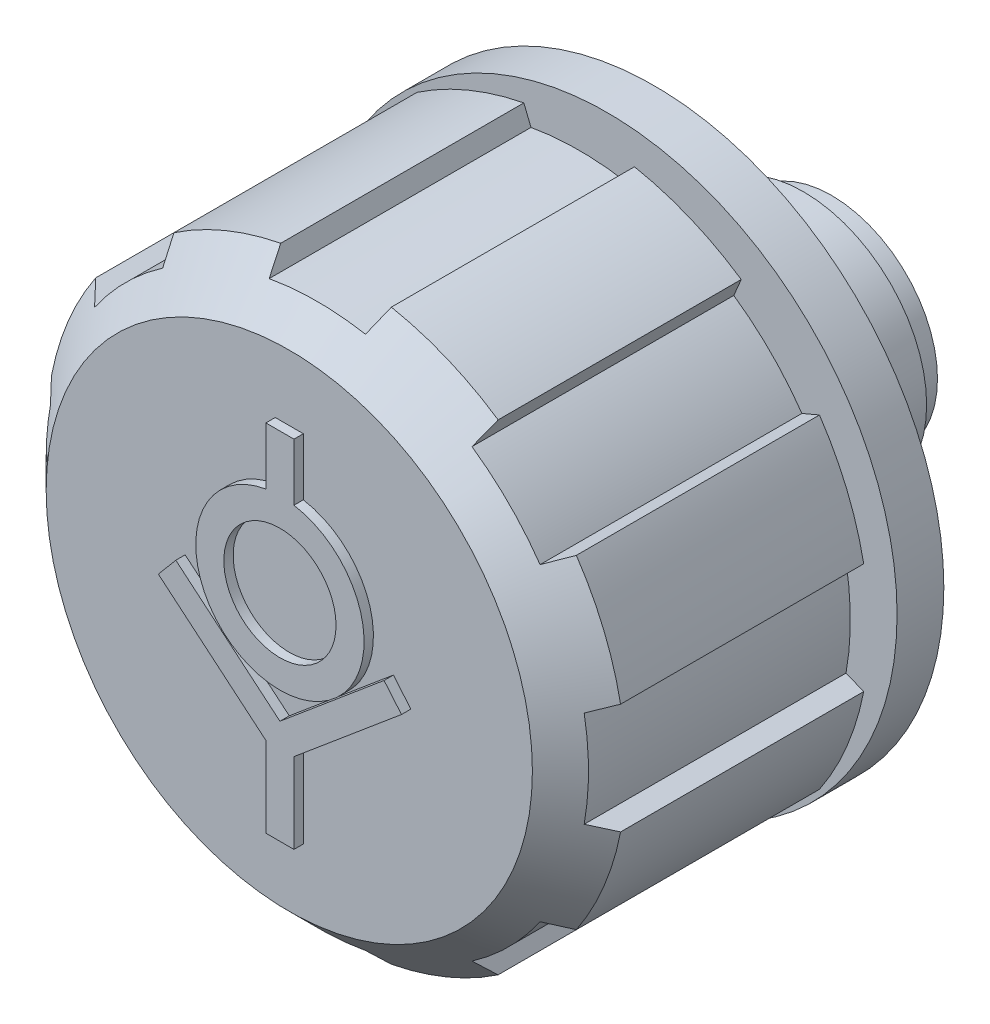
ISO-10303-21;
HEADER;
FILE_DESCRIPTION(('STEP AP214'),'2;1');
FILE_NAME('part.step','',(''),(''),'','','');
FILE_SCHEMA(('AUTOMOTIVE_DESIGN { 1 0 10303 214 1 1 1 1 }'));
ENDSEC;
DATA;
#1=APPLICATION_CONTEXT('core data for automotive mechanical design processes');
#2=APPLICATION_PROTOCOL_DEFINITION('international standard','automotive_design',2000,#1);
#3=PRODUCT_CONTEXT('',#1,'mechanical');
#4=PRODUCT('Part','Part','',(#3));
#5=PRODUCT_RELATED_PRODUCT_CATEGORY('part','',(#4));
#6=PRODUCT_DEFINITION_FORMATION('','',#4);
#7=PRODUCT_DEFINITION_CONTEXT('part definition',#1,'design');
#8=PRODUCT_DEFINITION('design','',#6,#7);
#9=PRODUCT_DEFINITION_SHAPE('','',#8);
#10=(LENGTH_UNIT() NAMED_UNIT(*) SI_UNIT(.MILLI.,.METRE.));
#11=(NAMED_UNIT(*) PLANE_ANGLE_UNIT() SI_UNIT($,.RADIAN.));
#12=(NAMED_UNIT(*) SI_UNIT($,.STERADIAN.) SOLID_ANGLE_UNIT());
#13=UNCERTAINTY_MEASURE_WITH_UNIT(LENGTH_MEASURE(1.E-05),#10,'distance_accuracy_value','');
#14=(GEOMETRIC_REPRESENTATION_CONTEXT(3) GLOBAL_UNCERTAINTY_ASSIGNED_CONTEXT((#13)) GLOBAL_UNIT_ASSIGNED_CONTEXT((#10,
#11,#12)) REPRESENTATION_CONTEXT('',''));
#15=CARTESIAN_POINT('',(0.,0.,0.));
#16=DIRECTION('',(0.,0.,1.));
#17=DIRECTION('',(1.,0.,0.));
#18=AXIS2_PLACEMENT_3D('',#15,#16,#17);
#19=CARTESIAN_POINT('',(0.,0.,4.75));
#20=DIRECTION('',(0.,0.,1.));
#21=DIRECTION('',(1.,0.,0.));
#22=AXIS2_PLACEMENT_3D('',#19,#20,#21);
#23=CYLINDRICAL_SURFACE('',#22,10.3333333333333);
#24=CARTESIAN_POINT('',(0.,0.,4.));
#25=DIRECTION('',(0.,0.,1.));
#26=DIRECTION('',(1.,0.,0.));
#27=AXIS2_PLACEMENT_3D('',#24,#25,#26);
#28=CIRCLE('',#27,10.3333333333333);
#29=CARTESIAN_POINT('',(10.3333333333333,0.,4.));
#30=VERTEX_POINT('',#29);
#31=EDGE_CURVE('E656',#30,#30,#28,.F.);
#32=ORIENTED_EDGE('',*,*,#31,.F.);
#33=EDGE_LOOP('',(#32));
#34=FACE_BOUND('',#33,.T.);
#35=CARTESIAN_POINT('',(0.,0.,5.5));
#36=DIRECTION('',(0.,0.,1.));
#37=DIRECTION('',(1.,0.,0.));
#38=AXIS2_PLACEMENT_3D('',#35,#36,#37);
#39=CIRCLE('',#38,10.3333333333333);
#40=CARTESIAN_POINT('',(10.3333333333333,0.,5.5));
#41=VERTEX_POINT('',#40);
#42=EDGE_CURVE('E657',#41,#41,#39,.F.);
#43=ORIENTED_EDGE('',*,*,#42,.T.);
#44=EDGE_LOOP('',(#43));
#45=FACE_BOUND('',#44,.T.);
#46=ADVANCED_FACE('F14',(#34,#45),#23,.T.);
#47=CARTESIAN_POINT('',(0.,12.9166666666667,4.));
#48=DIRECTION('',(0.,0.,1.));
#49=DIRECTION('',(1.,0.,0.));
#50=AXIS2_PLACEMENT_3D('',#47,#48,#49);
#51=PLANE('',#50);
#52=ORIENTED_EDGE('',*,*,#31,.T.);
#53=EDGE_LOOP('',(#52));
#54=FACE_BOUND('',#53,.T.);
#55=CARTESIAN_POINT('',(0.,0.,4.));
#56=DIRECTION('',(0.,0.,1.));
#57=DIRECTION('',(1.,0.,0.));
#58=AXIS2_PLACEMENT_3D('',#55,#56,#57);
#59=CIRCLE('',#58,15.5);
#60=CARTESIAN_POINT('',(15.5,0.,3.99999999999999));
#61=VERTEX_POINT('',#60);
#62=EDGE_CURVE('E666',#61,#61,#59,.F.);
#63=ORIENTED_EDGE('',*,*,#62,.F.);
#64=EDGE_LOOP('',(#63));
#65=FACE_BOUND('',#64,.T.);
#66=ADVANCED_FACE('F627',(#54,#65),#51,.T.);
#67=CARTESIAN_POINT('',(0.,0.,2.75));
#68=DIRECTION('',(0.,0.,1.));
#69=DIRECTION('',(1.,0.,0.));
#70=AXIS2_PLACEMENT_3D('',#67,#68,#69);
#71=CYLINDRICAL_SURFACE('',#70,15.5);
#72=CARTESIAN_POINT('',(0.,0.,1.5));
#73=DIRECTION('',(0.,0.,1.));
#74=DIRECTION('',(1.,0.,0.));
#75=AXIS2_PLACEMENT_3D('',#72,#73,#74);
#76=CIRCLE('',#75,15.5);
#77=CARTESIAN_POINT('',(15.5,0.,1.49999999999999));
#78=VERTEX_POINT('',#77);
#79=EDGE_CURVE('E672',#78,#78,#76,.F.);
#80=ORIENTED_EDGE('',*,*,#79,.F.);
#81=EDGE_LOOP('',(#80));
#82=FACE_BOUND('',#81,.T.);
#83=ORIENTED_EDGE('',*,*,#62,.T.);
#84=EDGE_LOOP('',(#83));
#85=FACE_BOUND('',#84,.T.);
#86=ADVANCED_FACE('F619',(#82,#85),#71,.T.);
#87=CARTESIAN_POINT('',(0.,14.7954545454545,1.5));
#88=DIRECTION('',(0.,0.,-1.));
#89=DIRECTION('',(-1.,0.,0.));
#90=AXIS2_PLACEMENT_3D('',#87,#88,#89);
#91=PLANE('',#90);
#92=ORIENTED_EDGE('',*,*,#79,.T.);
#93=EDGE_LOOP('',(#92));
#94=FACE_BOUND('',#93,.T.);
#95=CARTESIAN_POINT('',(0.,0.,1.5));
#96=DIRECTION('',(0.,0.,-1.));
#97=DIRECTION('',(-1.,0.,0.));
#98=AXIS2_PLACEMENT_3D('',#95,#96,#97);
#99=CIRCLE('',#98,9.1);
#100=CARTESIAN_POINT('',(-9.1,0.,1.5));
#101=VERTEX_POINT('',#100);
#102=EDGE_CURVE('E1068',#101,#101,#99,.F.);
#103=ORIENTED_EDGE('',*,*,#102,.T.);
#104=EDGE_LOOP('',(#103));
#105=FACE_BOUND('',#104,.T.);
#106=ADVANCED_FACE('F615',(#94,#105),#91,.T.);
#107=CARTESIAN_POINT('',(0.,14.95,5.5));
#108=DIRECTION('',(0.,0.,-1.));
#109=DIRECTION('',(-1.,0.,0.));
#110=AXIS2_PLACEMENT_3D('',#107,#108,#109);
#111=PLANE('',#110);
#112=DIRECTION('',(-0.927183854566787,0.374606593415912,0.));
#113=VECTOR('',#112,1.);
#114=CARTESIAN_POINT('',(-14.2694497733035,2.5754229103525,5.5));
#115=LINE('',#114,#113);
#116=CARTESIAN_POINT('',(-14.2694497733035,2.57542291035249,5.5));
#117=VERTEX_POINT('',#116);
#118=CARTESIAN_POINT('',(-15.2152213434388,2.95753942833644,5.5));
#119=VERTEX_POINT('',#118);
#120=EDGE_CURVE('E32',#117,#119,#115,.T.);
#121=ORIENTED_EDGE('',*,*,#120,.T.);
#122=CARTESIAN_POINT('',(0.,0.,5.5));
#123=DIRECTION('',(0.,0.,1.));
#124=DIRECTION('',(1.,0.,0.));
#125=AXIS2_PLACEMENT_3D('',#122,#123,#124);
#126=CIRCLE('',#125,15.5);
#127=CARTESIAN_POINT('',(-12.8500823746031,8.66749000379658,5.5));
#128=VERTEX_POINT('',#127);
#129=EDGE_CURVE('E9',#119,#128,#126,.F.);
#130=ORIENTED_EDGE('',*,*,#129,.T.);
#131=DIRECTION('',(0.92050485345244,-0.390731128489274,0.));
#132=VECTOR('',#131,1.);
#133=CARTESIAN_POINT('',(-12.8500823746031,8.66749000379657,5.5));
#134=LINE('',#133,#132);
#135=CARTESIAN_POINT('',(-11.9111237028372,8.26892569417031,5.5));
#136=VERTEX_POINT('',#135);
#137=EDGE_CURVE('E917',#128,#136,#134,.T.);
#138=ORIENTED_EDGE('',*,*,#137,.T.);
#139=CARTESIAN_POINT('',(0.,0.,5.5));
#140=DIRECTION('',(0.,0.,1.));
#141=DIRECTION('',(1.,0.,0.));
#142=AXIS2_PLACEMENT_3D('',#139,#140,#141);
#143=CIRCLE('',#142,14.5);
#144=CARTESIAN_POINT('',(-8.26892569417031,11.9111237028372,5.5));
#145=VERTEX_POINT('',#144);
#146=EDGE_CURVE('E423',#136,#145,#143,.F.);
#147=ORIENTED_EDGE('',*,*,#146,.T.);
#148=DIRECTION('',(-0.390731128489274,0.92050485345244,0.));
#149=VECTOR('',#148,1.);
#150=CARTESIAN_POINT('',(-8.26892569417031,11.9111237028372,5.5));
#151=LINE('',#150,#149);
#152=CARTESIAN_POINT('',(-8.66749000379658,12.8500823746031,5.5));
#153=VERTEX_POINT('',#152);
#154=EDGE_CURVE('E311',#145,#153,#151,.T.);
#155=ORIENTED_EDGE('',*,*,#154,.T.);
#156=CARTESIAN_POINT('',(0.,0.,5.5));
#157=DIRECTION('',(0.,0.,1.));
#158=DIRECTION('',(1.,0.,0.));
#159=AXIS2_PLACEMENT_3D('',#156,#157,#158);
#160=CIRCLE('',#159,15.5);
#161=CARTESIAN_POINT('',(-2.95753942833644,15.2152213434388,5.5));
#162=VERTEX_POINT('',#161);
#163=EDGE_CURVE('E420',#153,#162,#160,.F.);
#164=ORIENTED_EDGE('',*,*,#163,.T.);
#165=DIRECTION('',(0.374606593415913,-0.927183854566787,0.));
#166=VECTOR('',#165,1.);
#167=CARTESIAN_POINT('',(-2.95753942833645,15.2152213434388,5.5));
#168=LINE('',#167,#166);
#169=CARTESIAN_POINT('',(-2.5754229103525,14.2694497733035,5.5));
#170=VERTEX_POINT('',#169);
#171=EDGE_CURVE('E313',#162,#170,#168,.T.);
#172=ORIENTED_EDGE('',*,*,#171,.T.);
#173=CARTESIAN_POINT('',(0.,0.,5.5));
#174=DIRECTION('',(0.,0.,1.));
#175=DIRECTION('',(1.,0.,0.));
#176=AXIS2_PLACEMENT_3D('',#173,#174,#175);
#177=CIRCLE('',#176,14.5);
#178=CARTESIAN_POINT('',(2.5754229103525,14.2694497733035,5.5));
#179=VERTEX_POINT('',#178);
#180=EDGE_CURVE('E417',#170,#179,#177,.F.);
#181=ORIENTED_EDGE('',*,*,#180,.T.);
#182=DIRECTION('',(0.374606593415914,0.927183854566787,0.));
#183=VECTOR('',#182,1.);
#184=CARTESIAN_POINT('',(2.5754229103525,14.2694497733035,5.5));
#185=LINE('',#184,#183);
#186=CARTESIAN_POINT('',(2.95753942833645,15.2152213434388,5.5));
#187=VERTEX_POINT('',#186);
#188=EDGE_CURVE('E801',#179,#187,#185,.T.);
#189=ORIENTED_EDGE('',*,*,#188,.T.);
#190=CARTESIAN_POINT('',(0.,0.,5.5));
#191=DIRECTION('',(0.,0.,1.));
#192=DIRECTION('',(1.,0.,0.));
#193=AXIS2_PLACEMENT_3D('',#190,#191,#192);
#194=CIRCLE('',#193,15.5);
#195=CARTESIAN_POINT('',(8.6674900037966,12.8500823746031,5.5));
#196=VERTEX_POINT('',#195);
#197=EDGE_CURVE('E414',#187,#196,#194,.F.);
#198=ORIENTED_EDGE('',*,*,#197,.T.);
#199=DIRECTION('',(-0.390731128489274,-0.92050485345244,0.));
#200=VECTOR('',#199,1.);
#201=CARTESIAN_POINT('',(8.66749000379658,12.8500823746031,5.5));
#202=LINE('',#201,#200);
#203=CARTESIAN_POINT('',(8.26892569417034,11.9111237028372,5.5));
#204=VERTEX_POINT('',#203);
#205=EDGE_CURVE('E788',#196,#204,#202,.T.);
#206=ORIENTED_EDGE('',*,*,#205,.T.);
#207=CARTESIAN_POINT('',(0.,0.,5.5));
#208=DIRECTION('',(0.,0.,1.));
#209=DIRECTION('',(1.,0.,0.));
#210=AXIS2_PLACEMENT_3D('',#207,#208,#209);
#211=CIRCLE('',#210,14.5);
#212=CARTESIAN_POINT('',(11.9111237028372,8.26892569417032,5.5));
#213=VERTEX_POINT('',#212);
#214=EDGE_CURVE('E411',#204,#213,#211,.F.);
#215=ORIENTED_EDGE('',*,*,#214,.T.);
#216=DIRECTION('',(0.92050485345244,0.390731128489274,0.));
#217=VECTOR('',#216,1.);
#218=CARTESIAN_POINT('',(11.9111237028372,8.2689256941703,5.5));
#219=LINE('',#218,#217);
#220=CARTESIAN_POINT('',(12.8500823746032,8.66749000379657,5.5));
#221=VERTEX_POINT('',#220);
#222=EDGE_CURVE('E798',#213,#221,#219,.T.);
#223=ORIENTED_EDGE('',*,*,#222,.T.);
#224=CARTESIAN_POINT('',(0.,0.,5.5));
#225=DIRECTION('',(0.,0.,1.));
#226=DIRECTION('',(1.,0.,0.));
#227=AXIS2_PLACEMENT_3D('',#224,#225,#226);
#228=CIRCLE('',#227,15.5);
#229=CARTESIAN_POINT('',(15.2152213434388,2.95753942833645,5.5));
#230=VERTEX_POINT('',#229);
#231=EDGE_CURVE('E408',#221,#230,#228,.F.);
#232=ORIENTED_EDGE('',*,*,#231,.T.);
#233=DIRECTION('',(-0.927183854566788,-0.374606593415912,0.));
#234=VECTOR('',#233,1.);
#235=CARTESIAN_POINT('',(15.2152213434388,2.95753942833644,5.5));
#236=LINE('',#235,#234);
#237=CARTESIAN_POINT('',(14.2694497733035,2.57542291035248,5.5));
#238=VERTEX_POINT('',#237);
#239=EDGE_CURVE('E803',#230,#238,#236,.T.);
#240=ORIENTED_EDGE('',*,*,#239,.T.);
#241=CARTESIAN_POINT('',(0.,0.,5.5));
#242=DIRECTION('',(0.,0.,1.));
#243=DIRECTION('',(1.,0.,0.));
#244=AXIS2_PLACEMENT_3D('',#241,#242,#243);
#245=CIRCLE('',#244,14.5);
#246=CARTESIAN_POINT('',(14.2694497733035,-2.5754229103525,5.5));
#247=VERTEX_POINT('',#246);
#248=EDGE_CURVE('E405',#238,#247,#245,.F.);
#249=ORIENTED_EDGE('',*,*,#248,.T.);
#250=DIRECTION('',(0.927183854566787,-0.374606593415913,0.));
#251=VECTOR('',#250,1.);
#252=CARTESIAN_POINT('',(14.2694497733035,-2.57542291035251,5.5));
#253=LINE('',#252,#251);
#254=CARTESIAN_POINT('',(15.2152213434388,-2.95753942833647,5.5));
#255=VERTEX_POINT('',#254);
#256=EDGE_CURVE('E957',#247,#255,#253,.T.);
#257=ORIENTED_EDGE('',*,*,#256,.T.);
#258=CARTESIAN_POINT('',(0.,0.,5.5));
#259=DIRECTION('',(0.,0.,1.));
#260=DIRECTION('',(1.,0.,0.));
#261=AXIS2_PLACEMENT_3D('',#258,#259,#260);
#262=CIRCLE('',#261,15.5);
#263=CARTESIAN_POINT('',(12.8500823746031,-8.66749000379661,5.5));
#264=VERTEX_POINT('',#263);
#265=EDGE_CURVE('E402',#255,#264,#262,.F.);
#266=ORIENTED_EDGE('',*,*,#265,.T.);
#267=DIRECTION('',(-0.92050485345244,0.390731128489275,0.));
#268=VECTOR('',#267,1.);
#269=CARTESIAN_POINT('',(12.8500823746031,-8.66749000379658,5.5));
#270=LINE('',#269,#268);
#271=CARTESIAN_POINT('',(11.9111237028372,-8.26892569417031,5.5));
#272=VERTEX_POINT('',#271);
#273=EDGE_CURVE('E950',#264,#272,#270,.T.);
#274=ORIENTED_EDGE('',*,*,#273,.T.);
#275=CARTESIAN_POINT('',(0.,-1.06889924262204E-13,5.5));
#276=DIRECTION('',(0.,0.,1.));
#277=DIRECTION('',(1.,0.,0.));
#278=AXIS2_PLACEMENT_3D('',#275,#276,#277);
#279=CIRCLE('',#278,14.5);
#280=CARTESIAN_POINT('',(8.26892569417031,-11.9111237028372,5.5));
#281=VERTEX_POINT('',#280);
#282=EDGE_CURVE('E399',#272,#281,#279,.F.);
#283=ORIENTED_EDGE('',*,*,#282,.T.);
#284=DIRECTION('',(0.390731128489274,-0.92050485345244,0.));
#285=VECTOR('',#284,1.);
#286=CARTESIAN_POINT('',(8.2689256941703,-11.9111237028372,5.5));
#287=LINE('',#286,#285);
#288=CARTESIAN_POINT('',(8.66749000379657,-12.8500823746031,5.5));
#289=VERTEX_POINT('',#288);
#290=EDGE_CURVE('E944',#281,#289,#287,.T.);
#291=ORIENTED_EDGE('',*,*,#290,.T.);
#292=CARTESIAN_POINT('',(0.,0.,5.5));
#293=DIRECTION('',(0.,0.,1.));
#294=DIRECTION('',(1.,0.,0.));
#295=AXIS2_PLACEMENT_3D('',#292,#293,#294);
#296=CIRCLE('',#295,15.5);
#297=CARTESIAN_POINT('',(2.95753942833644,-15.2152213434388,5.5));
#298=VERTEX_POINT('',#297);
#299=EDGE_CURVE('E396',#289,#298,#296,.F.);
#300=ORIENTED_EDGE('',*,*,#299,.T.);
#301=DIRECTION('',(-0.374606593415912,0.927183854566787,0.));
#302=VECTOR('',#301,1.);
#303=CARTESIAN_POINT('',(2.95753942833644,-15.2152213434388,5.5));
#304=LINE('',#303,#302);
#305=CARTESIAN_POINT('',(2.57542291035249,-14.2694497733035,5.5));
#306=VERTEX_POINT('',#305);
#307=EDGE_CURVE('E696',#298,#306,#304,.T.);
#308=ORIENTED_EDGE('',*,*,#307,.T.);
#309=CARTESIAN_POINT('',(0.,0.,5.5));
#310=DIRECTION('',(0.,0.,1.));
#311=DIRECTION('',(1.,0.,0.));
#312=AXIS2_PLACEMENT_3D('',#309,#310,#311);
#313=CIRCLE('',#312,14.5);
#314=CARTESIAN_POINT('',(-2.57542291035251,-14.2694497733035,5.5));
#315=VERTEX_POINT('',#314);
#316=EDGE_CURVE('E393',#306,#315,#313,.F.);
#317=ORIENTED_EDGE('',*,*,#316,.T.);
#318=DIRECTION('',(-0.374606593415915,-0.927183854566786,0.));
#319=VECTOR('',#318,1.);
#320=CARTESIAN_POINT('',(-2.5754229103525,-14.2694497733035,5.5));
#321=LINE('',#320,#319);
#322=CARTESIAN_POINT('',(-2.95753942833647,-15.2152213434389,5.5));
#323=VERTEX_POINT('',#322);
#324=EDGE_CURVE('E931',#315,#323,#321,.T.);
#325=ORIENTED_EDGE('',*,*,#324,.T.);
#326=CARTESIAN_POINT('',(0.,-1.22877135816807E-13,5.5));
#327=DIRECTION('',(0.,0.,1.));
#328=DIRECTION('',(1.,0.,0.));
#329=AXIS2_PLACEMENT_3D('',#326,#327,#328);
#330=CIRCLE('',#329,15.5);
#331=CARTESIAN_POINT('',(-8.66749000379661,-12.8500823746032,5.5));
#332=VERTEX_POINT('',#331);
#333=EDGE_CURVE('E390',#323,#332,#330,.F.);
#334=ORIENTED_EDGE('',*,*,#333,.T.);
#335=DIRECTION('',(0.390731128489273,0.920504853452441,0.));
#336=VECTOR('',#335,1.);
#337=CARTESIAN_POINT('',(-8.66749000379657,-12.8500823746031,5.5));
#338=LINE('',#337,#336);
#339=CARTESIAN_POINT('',(-8.2689256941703,-11.9111237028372,5.5));
#340=VERTEX_POINT('',#339);
#341=EDGE_CURVE('E925',#332,#340,#338,.T.);
#342=ORIENTED_EDGE('',*,*,#341,.T.);
#343=CARTESIAN_POINT('',(0.,-1.29982563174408E-13,5.5));
#344=DIRECTION('',(0.,0.,1.));
#345=DIRECTION('',(1.,0.,0.));
#346=AXIS2_PLACEMENT_3D('',#343,#344,#345);
#347=CIRCLE('',#346,14.4999999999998);
#348=CARTESIAN_POINT('',(-11.9111237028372,-8.26892569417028,5.5));
#349=VERTEX_POINT('',#348);
#350=EDGE_CURVE('E387',#340,#349,#347,.F.);
#351=ORIENTED_EDGE('',*,*,#350,.T.);
#352=DIRECTION('',(-0.920504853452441,-0.390731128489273,0.));
#353=VECTOR('',#352,1.);
#354=CARTESIAN_POINT('',(-11.9111237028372,-8.2689256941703,5.5));
#355=LINE('',#354,#353);
#356=CARTESIAN_POINT('',(-12.8500823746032,-8.66749000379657,5.5));
#357=VERTEX_POINT('',#356);
#358=EDGE_CURVE('E510',#349,#357,#355,.T.);
#359=ORIENTED_EDGE('',*,*,#358,.T.);
#360=CARTESIAN_POINT('',(0.,0.,5.5));
#361=DIRECTION('',(0.,0.,1.));
#362=DIRECTION('',(1.,0.,0.));
#363=AXIS2_PLACEMENT_3D('',#360,#361,#362);
#364=CIRCLE('',#363,15.5);
#365=CARTESIAN_POINT('',(-15.2152213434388,-2.95753942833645,5.5));
#366=VERTEX_POINT('',#365);
#367=EDGE_CURVE('E384',#357,#366,#364,.F.);
#368=ORIENTED_EDGE('',*,*,#367,.T.);
#369=DIRECTION('',(0.927183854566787,0.374606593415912,0.));
#370=VECTOR('',#369,1.);
#371=CARTESIAN_POINT('',(-15.2152213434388,-2.95753942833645,5.5));
#372=LINE('',#371,#370);
#373=CARTESIAN_POINT('',(-14.2694497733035,-2.57542291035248,5.5));
#374=VERTEX_POINT('',#373);
#375=EDGE_CURVE('E506',#366,#374,#372,.T.);
#376=ORIENTED_EDGE('',*,*,#375,.T.);
#377=CARTESIAN_POINT('',(0.,0.,5.5));
#378=DIRECTION('',(0.,0.,1.));
#379=DIRECTION('',(1.,0.,0.));
#380=AXIS2_PLACEMENT_3D('',#377,#378,#379);
#381=CIRCLE('',#380,14.5);
#382=EDGE_CURVE('E24',#374,#117,#381,.F.);
#383=ORIENTED_EDGE('',*,*,#382,.T.);
#384=EDGE_LOOP('',(#121,#130,#138,#147,#155,#164,#172,#181,#189,#198,#206,#215,#223,#232,#240,
#249,#257,#266,#274,#283,#291,#300,#308,#317,#325,#334,#342,#351,#359,#368,#376,#383));
#385=FACE_BOUND('',#384,.T.);
#386=ORIENTED_EDGE('',*,*,#42,.F.);
#387=EDGE_LOOP('',(#386));
#388=FACE_BOUND('',#387,.T.);
#389=ADVANCED_FACE('F618',(#385,#388),#111,.T.);
#390=CARTESIAN_POINT('',(-14.2694497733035,2.5754229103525,21.5));
#391=DIRECTION('',(0.374606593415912,0.927183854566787,0.));
#392=DIRECTION('',(-0.927183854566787,0.374606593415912,0.));
#393=AXIS2_PLACEMENT_3D('',#390,#391,#392);
#394=PLANE('',#393);
#395=DIRECTION('',(0.,0.,1.));
#396=VECTOR('',#395,1.);
#397=CARTESIAN_POINT('',(-15.2152213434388,2.95753942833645,21.5));
#398=LINE('',#397,#396);
#399=CARTESIAN_POINT('',(-15.2152213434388,2.95753942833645,18.5));
#400=VERTEX_POINT('',#399);
#401=EDGE_CURVE('E426',#119,#400,#398,.T.);
#402=ORIENTED_EDGE('',*,*,#401,.F.);
#403=ORIENTED_EDGE('',*,*,#120,.F.);
#404=DIRECTION('',(0.,0.,1.));
#405=VECTOR('',#404,1.);
#406=CARTESIAN_POINT('',(-14.2694497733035,2.5754229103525,21.5));
#407=LINE('',#406,#405);
#408=CARTESIAN_POINT('',(-14.2694497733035,2.5754229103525,19.5));
#409=VERTEX_POINT('',#408);
#410=EDGE_CURVE('E922',#409,#117,#407,.F.);
#411=ORIENTED_EDGE('',*,*,#410,.F.);
#412=CARTESIAN_POINT('',(-15.2152213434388,2.95753942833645,18.5));
#413=CARTESIAN_POINT('',(-15.0576970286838,2.89389547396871,18.6667813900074));
#414=CARTESIAN_POINT('',(-14.9001205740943,2.83023045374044,18.8335054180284));
#415=CARTESIAN_POINT('',(-14.58486338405,2.70285828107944,19.1668387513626));
#416=CARTESIAN_POINT('',(-14.4271826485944,2.6391511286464,19.3334480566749));
#417=CARTESIAN_POINT('',(-14.2694497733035,2.5754229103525,19.5));
#418=B_SPLINE_CURVE_WITH_KNOTS('',3,(#412,#413,#414,#415,#416,#417),.UNSPECIFIED.,.F.,.F.,(4,2,
4),(0.,0.714229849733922,1.42845970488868),.UNSPECIFIED.);
#419=EDGE_CURVE('E427',#400,#409,#418,.T.);
#420=ORIENTED_EDGE('',*,*,#419,.F.);
#421=EDGE_LOOP('',(#402,#403,#411,#420));
#422=FACE_BOUND('',#421,.T.);
#423=ADVANCED_FACE('F444',(#422),#394,.F.);
#424=CARTESIAN_POINT('',(0.,0.,21.5));
#425=DIRECTION('',(0.,0.,1.));
#426=DIRECTION('',(1.,0.,0.));
#427=AXIS2_PLACEMENT_3D('',#424,#425,#426);
#428=CYLINDRICAL_SURFACE('',#427,15.5);
#429=ORIENTED_EDGE('',*,*,#129,.F.);
#430=ORIENTED_EDGE('',*,*,#401,.T.);
#431=CARTESIAN_POINT('',(0.,0.,18.5));
#432=DIRECTION('',(0.,0.,1.));
#433=DIRECTION('',(1.,0.,0.));
#434=AXIS2_PLACEMENT_3D('',#431,#432,#433);
#435=CIRCLE('',#434,15.5);
#436=CARTESIAN_POINT('',(-12.8500823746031,8.66749000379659,18.5));
#437=VERTEX_POINT('',#436);
#438=EDGE_CURVE('E913',#400,#437,#435,.F.);
#439=ORIENTED_EDGE('',*,*,#438,.T.);
#440=DIRECTION('',(0.,0.,1.));
#441=VECTOR('',#440,1.);
#442=CARTESIAN_POINT('',(-12.8500823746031,8.66749000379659,21.5));
#443=LINE('',#442,#441);
#444=EDGE_CURVE('E915',#437,#128,#443,.F.);
#445=ORIENTED_EDGE('',*,*,#444,.T.);
#446=EDGE_LOOP('',(#429,#430,#439,#445));
#447=FACE_BOUND('',#446,.T.);
#448=ADVANCED_FACE('F1121',(#447),#428,.T.);
#449=CARTESIAN_POINT('',(-12.8500823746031,8.66749000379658,21.5));
#450=DIRECTION('',(-0.390731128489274,-0.92050485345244,0.));
#451=DIRECTION('',(0.92050485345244,-0.390731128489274,0.));
#452=AXIS2_PLACEMENT_3D('',#449,#450,#451);
#453=PLANE('',#452);
#454=DIRECTION('',(0.,0.,1.));
#455=VECTOR('',#454,1.);
#456=CARTESIAN_POINT('',(-11.9111237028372,8.2689256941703,21.5));
#457=LINE('',#456,#455);
#458=CARTESIAN_POINT('',(-11.9111237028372,8.26892569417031,19.5));
#459=VERTEX_POINT('',#458);
#460=EDGE_CURVE('E824',#136,#459,#457,.T.);
#461=ORIENTED_EDGE('',*,*,#460,.F.);
#462=ORIENTED_EDGE('',*,*,#137,.F.);
#463=ORIENTED_EDGE('',*,*,#444,.F.);
#464=CARTESIAN_POINT('',(-11.9111237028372,8.26892569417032,19.5));
#465=CARTESIAN_POINT('',(-12.06772034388,8.33539702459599,19.3334480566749));
#466=CARTESIAN_POINT('',(-12.2242652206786,8.40184638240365,19.1668387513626));
#467=CARTESIAN_POINT('',(-12.5372514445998,8.53470115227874,18.8335054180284));
#468=CARTESIAN_POINT('',(-12.6936927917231,8.60110656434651,18.6667813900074));
#469=CARTESIAN_POINT('',(-12.8500823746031,8.66749000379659,18.5));
#470=B_SPLINE_CURVE_WITH_KNOTS('',3,(#464,#465,#466,#467,#468,#469),.UNSPECIFIED.,.F.,.F.,(4,2,
4),(0.,0.714229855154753,1.42845970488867),.UNSPECIFIED.);
#471=EDGE_CURVE('E437',#459,#437,#470,.T.);
#472=ORIENTED_EDGE('',*,*,#471,.F.);
#473=EDGE_LOOP('',(#461,#462,#463,#472));
#474=FACE_BOUND('',#473,.T.);
#475=ADVANCED_FACE('F453',(#474),#453,.F.);
#476=CARTESIAN_POINT('',(0.,0.,21.5));
#477=DIRECTION('',(0.,0.,1.));
#478=DIRECTION('',(1.,0.,0.));
#479=AXIS2_PLACEMENT_3D('',#476,#477,#478);
#480=CYLINDRICAL_SURFACE('',#479,14.5);
#481=ORIENTED_EDGE('',*,*,#146,.F.);
#482=ORIENTED_EDGE('',*,*,#460,.T.);
#483=CARTESIAN_POINT('',(0.,0.,19.5));
#484=DIRECTION('',(0.,0.,1.));
#485=DIRECTION('',(1.,0.,0.));
#486=AXIS2_PLACEMENT_3D('',#483,#484,#485);
#487=CIRCLE('',#486,14.5);
#488=CARTESIAN_POINT('',(-8.2689256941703,11.9111237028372,19.5));
#489=VERTEX_POINT('',#488);
#490=EDGE_CURVE('E436',#459,#489,#487,.F.);
#491=ORIENTED_EDGE('',*,*,#490,.T.);
#492=DIRECTION('',(0.,0.,1.));
#493=VECTOR('',#492,1.);
#494=CARTESIAN_POINT('',(-8.2689256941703,11.9111237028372,21.5));
#495=LINE('',#494,#493);
#496=EDGE_CURVE('E825',#489,#145,#495,.F.);
#497=ORIENTED_EDGE('',*,*,#496,.T.);
#498=EDGE_LOOP('',(#481,#482,#491,#497));
#499=FACE_BOUND('',#498,.T.);
#500=ADVANCED_FACE('F539',(#499),#480,.T.);
#501=CARTESIAN_POINT('',(-8.2689256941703,11.9111237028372,21.5));
#502=DIRECTION('',(0.92050485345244,0.390731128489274,0.));
#503=DIRECTION('',(-0.390731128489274,0.92050485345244,0.));
#504=AXIS2_PLACEMENT_3D('',#501,#502,#503);
#505=PLANE('',#504);
#506=DIRECTION('',(0.,0.,1.));
#507=VECTOR('',#506,1.);
#508=CARTESIAN_POINT('',(-8.66749000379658,12.8500823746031,21.5));
#509=LINE('',#508,#507);
#510=CARTESIAN_POINT('',(-8.66749000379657,12.8500823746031,18.5));
#511=VERTEX_POINT('',#510);
#512=EDGE_CURVE('E909',#153,#511,#509,.T.);
#513=ORIENTED_EDGE('',*,*,#512,.F.);
#514=ORIENTED_EDGE('',*,*,#154,.F.);
#515=ORIENTED_EDGE('',*,*,#496,.F.);
#516=CARTESIAN_POINT('',(-8.66749000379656,12.8500823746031,18.5));
#517=CARTESIAN_POINT('',(-8.60110656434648,12.6936927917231,18.6667813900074));
#518=CARTESIAN_POINT('',(-8.53470115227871,12.5372514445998,18.8335054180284));
#519=CARTESIAN_POINT('',(-8.40184638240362,12.2242652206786,19.1668387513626));
#520=CARTESIAN_POINT('',(-8.33539702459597,12.06772034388,19.3334480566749));
#521=CARTESIAN_POINT('',(-8.2689256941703,11.9111237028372,19.5));
#522=B_SPLINE_CURVE_WITH_KNOTS('',3,(#516,#517,#518,#519,#520,#521),.UNSPECIFIED.,.F.,.F.,(4,2,
4),(0.,0.714229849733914,1.42845970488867),.UNSPECIFIED.);
#523=EDGE_CURVE('E461',#511,#489,#522,.T.);
#524=ORIENTED_EDGE('',*,*,#523,.F.);
#525=EDGE_LOOP('',(#513,#514,#515,#524));
#526=FACE_BOUND('',#525,.T.);
#527=ADVANCED_FACE('F535',(#526),#505,.F.);
#528=CARTESIAN_POINT('',(0.,0.,21.5));
#529=DIRECTION('',(0.,0.,1.));
#530=DIRECTION('',(1.,0.,0.));
#531=AXIS2_PLACEMENT_3D('',#528,#529,#530);
#532=CYLINDRICAL_SURFACE('',#531,15.5);
#533=ORIENTED_EDGE('',*,*,#163,.F.);
#534=ORIENTED_EDGE('',*,*,#512,.T.);
#535=CARTESIAN_POINT('',(0.,0.,18.5));
#536=DIRECTION('',(0.,0.,1.));
#537=DIRECTION('',(1.,0.,0.));
#538=AXIS2_PLACEMENT_3D('',#535,#536,#537);
#539=CIRCLE('',#538,15.5);
#540=CARTESIAN_POINT('',(-2.95753942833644,15.2152213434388,18.5));
#541=VERTEX_POINT('',#540);
#542=EDGE_CURVE('E821',#511,#541,#539,.F.);
#543=ORIENTED_EDGE('',*,*,#542,.T.);
#544=DIRECTION('',(0.,0.,1.));
#545=VECTOR('',#544,1.);
#546=CARTESIAN_POINT('',(-2.95753942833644,15.2152213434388,21.5));
#547=LINE('',#546,#545);
#548=EDGE_CURVE('E823',#541,#162,#547,.F.);
#549=ORIENTED_EDGE('',*,*,#548,.T.);
#550=EDGE_LOOP('',(#533,#534,#543,#549));
#551=FACE_BOUND('',#550,.T.);
#552=ADVANCED_FACE('F530',(#551),#532,.T.);
#553=CARTESIAN_POINT('',(-2.95753942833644,15.2152213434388,21.5));
#554=DIRECTION('',(-0.927183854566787,-0.374606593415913,0.));
#555=DIRECTION('',(0.374606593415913,-0.927183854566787,0.));
#556=AXIS2_PLACEMENT_3D('',#553,#554,#555);
#557=PLANE('',#556);
#558=DIRECTION('',(0.,0.,1.));
#559=VECTOR('',#558,1.);
#560=CARTESIAN_POINT('',(-2.57542291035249,14.2694497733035,21.5));
#561=LINE('',#560,#559);
#562=CARTESIAN_POINT('',(-2.57542291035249,14.2694497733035,19.5));
#563=VERTEX_POINT('',#562);
#564=EDGE_CURVE('E818',#170,#563,#561,.T.);
#565=ORIENTED_EDGE('',*,*,#564,.F.);
#566=ORIENTED_EDGE('',*,*,#171,.F.);
#567=ORIENTED_EDGE('',*,*,#548,.F.);
#568=CARTESIAN_POINT('',(-2.57542291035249,14.2694497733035,19.5));
#569=CARTESIAN_POINT('',(-2.63915112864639,14.4271826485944,19.3334480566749));
#570=CARTESIAN_POINT('',(-2.70285828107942,14.58486338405,19.1668387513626));
#571=CARTESIAN_POINT('',(-2.83023045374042,14.9001205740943,18.8335054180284));
#572=CARTESIAN_POINT('',(-2.8938954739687,15.0576970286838,18.6667813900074));
#573=CARTESIAN_POINT('',(-2.95753942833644,15.2152213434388,18.5));
#574=B_SPLINE_CURVE_WITH_KNOTS('',3,(#568,#569,#570,#571,#572,#573),.UNSPECIFIED.,.F.,.F.,(4,2,
4),(0.,0.714229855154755,1.42845970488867),.UNSPECIFIED.);
#575=EDGE_CURVE('E502',#563,#541,#574,.T.);
#576=ORIENTED_EDGE('',*,*,#575,.F.);
#577=EDGE_LOOP('',(#565,#566,#567,#576));
#578=FACE_BOUND('',#577,.T.);
#579=ADVANCED_FACE('F526',(#578),#557,.F.);
#580=CARTESIAN_POINT('',(0.,0.,21.5));
#581=DIRECTION('',(0.,0.,1.));
#582=DIRECTION('',(1.,0.,0.));
#583=AXIS2_PLACEMENT_3D('',#580,#581,#582);
#584=CYLINDRICAL_SURFACE('',#583,14.5);
#585=ORIENTED_EDGE('',*,*,#564,.T.);
#586=CARTESIAN_POINT('',(0.,0.,19.5));
#587=DIRECTION('',(0.,0.,1.));
#588=DIRECTION('',(1.,0.,0.));
#589=AXIS2_PLACEMENT_3D('',#586,#587,#588);
#590=CIRCLE('',#589,14.5);
#591=CARTESIAN_POINT('',(2.57542291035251,14.2694497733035,19.5));
#592=VERTEX_POINT('',#591);
#593=EDGE_CURVE('E815',#563,#592,#590,.F.);
#594=ORIENTED_EDGE('',*,*,#593,.T.);
#595=DIRECTION('',(0.,0.,1.));
#596=VECTOR('',#595,1.);
#597=CARTESIAN_POINT('',(2.57542291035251,14.2694497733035,21.5));
#598=LINE('',#597,#596);
#599=EDGE_CURVE('E995',#592,#179,#598,.F.);
#600=ORIENTED_EDGE('',*,*,#599,.T.);
#601=ORIENTED_EDGE('',*,*,#180,.F.);
#602=EDGE_LOOP('',(#585,#594,#600,#601));
#603=FACE_BOUND('',#602,.T.);
#604=ADVANCED_FACE('F529',(#603),#584,.T.);
#605=CARTESIAN_POINT('',(2.57542291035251,14.2694497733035,21.5));
#606=DIRECTION('',(0.927183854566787,-0.374606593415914,0.));
#607=DIRECTION('',(0.374606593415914,0.927183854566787,0.));
#608=AXIS2_PLACEMENT_3D('',#605,#606,#607);
#609=PLANE('',#608);
#610=DIRECTION('',(0.,0.,1.));
#611=VECTOR('',#610,1.);
#612=CARTESIAN_POINT('',(2.95753942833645,15.2152213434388,21.5));
#613=LINE('',#612,#611);
#614=CARTESIAN_POINT('',(2.95753942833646,15.2152213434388,18.5));
#615=VERTEX_POINT('',#614);
#616=EDGE_CURVE('E809',#187,#615,#613,.T.);
#617=ORIENTED_EDGE('',*,*,#616,.F.);
#618=ORIENTED_EDGE('',*,*,#188,.F.);
#619=ORIENTED_EDGE('',*,*,#599,.F.);
#620=CARTESIAN_POINT('',(2.95753942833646,15.2152213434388,18.5));
#621=CARTESIAN_POINT('',(2.89389547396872,15.0576970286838,18.6667813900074));
#622=CARTESIAN_POINT('',(2.83023045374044,14.9001205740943,18.8335054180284));
#623=CARTESIAN_POINT('',(2.70285828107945,14.58486338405,19.1668387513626));
#624=CARTESIAN_POINT('',(2.63915112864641,14.4271826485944,19.3334480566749));
#625=CARTESIAN_POINT('',(2.57542291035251,14.2694497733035,19.5));
#626=B_SPLINE_CURVE_WITH_KNOTS('',3,(#620,#621,#622,#623,#624,#625),.UNSPECIFIED.,.F.,.F.,(4,2,
4),(0.,0.714229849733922,1.42845970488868),.UNSPECIFIED.);
#627=EDGE_CURVE('E518',#615,#592,#626,.T.);
#628=ORIENTED_EDGE('',*,*,#627,.F.);
#629=EDGE_LOOP('',(#617,#618,#619,#628));
#630=FACE_BOUND('',#629,.T.);
#631=ADVANCED_FACE('F532',(#630),#609,.F.);
#632=CARTESIAN_POINT('',(0.,0.,21.5));
#633=DIRECTION('',(0.,0.,1.));
#634=DIRECTION('',(1.,0.,0.));
#635=AXIS2_PLACEMENT_3D('',#632,#633,#634);
#636=CYLINDRICAL_SURFACE('',#635,15.5);
#637=ORIENTED_EDGE('',*,*,#197,.F.);
#638=ORIENTED_EDGE('',*,*,#616,.T.);
#639=CARTESIAN_POINT('',(0.,0.,18.5));
#640=DIRECTION('',(0.,0.,1.));
#641=DIRECTION('',(1.,0.,0.));
#642=AXIS2_PLACEMENT_3D('',#639,#640,#641);
#643=CIRCLE('',#642,15.5);
#644=CARTESIAN_POINT('',(8.6674900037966,12.8500823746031,18.5));
#645=VERTEX_POINT('',#644);
#646=EDGE_CURVE('E811',#615,#645,#643,.F.);
#647=ORIENTED_EDGE('',*,*,#646,.T.);
#648=DIRECTION('',(0.,0.,1.));
#649=VECTOR('',#648,1.);
#650=CARTESIAN_POINT('',(8.66749000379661,12.8500823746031,21.5));
#651=LINE('',#650,#649);
#652=EDGE_CURVE('E814',#645,#196,#651,.F.);
#653=ORIENTED_EDGE('',*,*,#652,.T.);
#654=EDGE_LOOP('',(#637,#638,#647,#653));
#655=FACE_BOUND('',#654,.T.);
#656=ADVANCED_FACE('F773',(#655),#636,.T.);
#657=CARTESIAN_POINT('',(8.66749000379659,12.8500823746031,21.5));
#658=DIRECTION('',(-0.92050485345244,0.390731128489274,0.));
#659=DIRECTION('',(-0.390731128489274,-0.92050485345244,0.));
#660=AXIS2_PLACEMENT_3D('',#657,#658,#659);
#661=PLANE('',#660);
#662=DIRECTION('',(0.,0.,1.));
#663=VECTOR('',#662,1.);
#664=CARTESIAN_POINT('',(8.26892569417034,11.9111237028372,21.5));
#665=LINE('',#664,#663);
#666=CARTESIAN_POINT('',(8.26892569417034,11.9111237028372,19.5));
#667=VERTEX_POINT('',#666);
#668=EDGE_CURVE('E785',#204,#667,#665,.T.);
#669=ORIENTED_EDGE('',*,*,#668,.F.);
#670=ORIENTED_EDGE('',*,*,#205,.F.);
#671=ORIENTED_EDGE('',*,*,#652,.F.);
#672=CARTESIAN_POINT('',(8.26892569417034,11.9111237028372,19.5));
#673=CARTESIAN_POINT('',(8.33539702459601,12.06772034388,19.3334480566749));
#674=CARTESIAN_POINT('',(8.40184638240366,12.2242652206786,19.1668387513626));
#675=CARTESIAN_POINT('',(8.53470115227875,12.5372514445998,18.8335054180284));
#676=CARTESIAN_POINT('',(8.60110656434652,12.6936927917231,18.6667813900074));
#677=CARTESIAN_POINT('',(8.6674900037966,12.8500823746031,18.5));
#678=B_SPLINE_CURVE_WITH_KNOTS('',3,(#672,#673,#674,#675,#676,#677),.UNSPECIFIED.,.F.,.F.,(4,2,
4),(0.,0.714229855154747,1.42845970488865),.UNSPECIFIED.);
#679=EDGE_CURVE('E713',#667,#645,#678,.T.);
#680=ORIENTED_EDGE('',*,*,#679,.F.);
#681=EDGE_LOOP('',(#669,#670,#671,#680));
#682=FACE_BOUND('',#681,.T.);
#683=ADVANCED_FACE('F770',(#682),#661,.F.);
#684=CARTESIAN_POINT('',(0.,0.,21.5));
#685=DIRECTION('',(0.,0.,1.));
#686=DIRECTION('',(1.,0.,0.));
#687=AXIS2_PLACEMENT_3D('',#684,#685,#686);
#688=CYLINDRICAL_SURFACE('',#687,14.5);
#689=ORIENTED_EDGE('',*,*,#214,.F.);
#690=ORIENTED_EDGE('',*,*,#668,.T.);
#691=CARTESIAN_POINT('',(0.,0.,19.5));
#692=DIRECTION('',(0.,0.,1.));
#693=DIRECTION('',(1.,0.,0.));
#694=AXIS2_PLACEMENT_3D('',#691,#692,#693);
#695=CIRCLE('',#694,14.5);
#696=CARTESIAN_POINT('',(11.9111237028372,8.26892569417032,19.5));
#697=VERTEX_POINT('',#696);
#698=EDGE_CURVE('E808',#667,#697,#695,.F.);
#699=ORIENTED_EDGE('',*,*,#698,.T.);
#700=DIRECTION('',(0.,0.,1.));
#701=VECTOR('',#700,1.);
#702=CARTESIAN_POINT('',(11.9111237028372,8.26892569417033,21.5));
#703=LINE('',#702,#701);
#704=EDGE_CURVE('E793',#697,#213,#703,.F.);
#705=ORIENTED_EDGE('',*,*,#704,.T.);
#706=EDGE_LOOP('',(#689,#690,#699,#705));
#707=FACE_BOUND('',#706,.T.);
#708=ADVANCED_FACE('F768',(#707),#688,.T.);
#709=CARTESIAN_POINT('',(11.9111237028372,8.26892569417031,21.5));
#710=DIRECTION('',(0.390731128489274,-0.92050485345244,0.));
#711=DIRECTION('',(0.92050485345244,0.390731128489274,0.));
#712=AXIS2_PLACEMENT_3D('',#709,#710,#711);
#713=PLANE('',#712);
#714=DIRECTION('',(0.,0.,1.));
#715=VECTOR('',#714,1.);
#716=CARTESIAN_POINT('',(12.8500823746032,8.66749000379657,21.5));
#717=LINE('',#716,#715);
#718=CARTESIAN_POINT('',(12.8500823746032,8.66749000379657,18.5));
#719=VERTEX_POINT('',#718);
#720=EDGE_CURVE('E973',#221,#719,#717,.T.);
#721=ORIENTED_EDGE('',*,*,#720,.F.);
#722=ORIENTED_EDGE('',*,*,#222,.F.);
#723=ORIENTED_EDGE('',*,*,#704,.F.);
#724=CARTESIAN_POINT('',(12.8500823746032,8.66749000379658,18.5));
#725=CARTESIAN_POINT('',(12.6936927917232,8.6011065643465,18.6667813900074));
#726=CARTESIAN_POINT('',(12.5372514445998,8.53470115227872,18.8335054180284));
#727=CARTESIAN_POINT('',(12.2242652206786,8.40184638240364,19.1668387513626));
#728=CARTESIAN_POINT('',(12.06772034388,8.33539702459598,19.3334480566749));
#729=CARTESIAN_POINT('',(11.9111237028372,8.26892569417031,19.5));
#730=B_SPLINE_CURVE_WITH_KNOTS('',3,(#724,#725,#726,#727,#728,#729),.UNSPECIFIED.,.F.,.F.,(4,2,
4),(0.,0.714229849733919,1.42845970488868),.UNSPECIFIED.);
#731=EDGE_CURVE('E720',#719,#697,#730,.T.);
#732=ORIENTED_EDGE('',*,*,#731,.F.);
#733=EDGE_LOOP('',(#721,#722,#723,#732));
#734=FACE_BOUND('',#733,.T.);
#735=ADVANCED_FACE('F765',(#734),#713,.F.);
#736=CARTESIAN_POINT('',(0.,0.,21.5));
#737=DIRECTION('',(0.,0.,1.));
#738=DIRECTION('',(1.,0.,0.));
#739=AXIS2_PLACEMENT_3D('',#736,#737,#738);
#740=CYLINDRICAL_SURFACE('',#739,15.5);
#741=ORIENTED_EDGE('',*,*,#231,.F.);
#742=ORIENTED_EDGE('',*,*,#720,.T.);
#743=CARTESIAN_POINT('',(0.,0.,18.5));
#744=DIRECTION('',(0.,0.,1.));
#745=DIRECTION('',(1.,0.,0.));
#746=AXIS2_PLACEMENT_3D('',#743,#744,#745);
#747=CIRCLE('',#746,15.5);
#748=CARTESIAN_POINT('',(15.2152213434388,2.95753942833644,18.5));
#749=VERTEX_POINT('',#748);
#750=EDGE_CURVE('E792',#719,#749,#747,.F.);
#751=ORIENTED_EDGE('',*,*,#750,.T.);
#752=DIRECTION('',(0.,0.,1.));
#753=VECTOR('',#752,1.);
#754=CARTESIAN_POINT('',(15.2152213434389,2.95753942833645,21.5));
#755=LINE('',#754,#753);
#756=EDGE_CURVE('E981',#749,#230,#755,.F.);
#757=ORIENTED_EDGE('',*,*,#756,.T.);
#758=EDGE_LOOP('',(#741,#742,#751,#757));
#759=FACE_BOUND('',#758,.T.);
#760=ADVANCED_FACE('F763',(#759),#740,.T.);
#761=CARTESIAN_POINT('',(15.2152213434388,2.95753942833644,21.5));
#762=DIRECTION('',(-0.374606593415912,0.927183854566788,0.));
#763=DIRECTION('',(-0.927183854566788,-0.374606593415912,0.));
#764=AXIS2_PLACEMENT_3D('',#761,#762,#763);
#765=PLANE('',#764);
#766=DIRECTION('',(0.,0.,1.));
#767=VECTOR('',#766,1.);
#768=CARTESIAN_POINT('',(14.2694497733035,2.57542291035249,21.5));
#769=LINE('',#768,#767);
#770=CARTESIAN_POINT('',(14.2694497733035,2.57542291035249,19.5));
#771=VERTEX_POINT('',#770);
#772=EDGE_CURVE('E968',#238,#771,#769,.T.);
#773=ORIENTED_EDGE('',*,*,#772,.F.);
#774=ORIENTED_EDGE('',*,*,#239,.F.);
#775=ORIENTED_EDGE('',*,*,#756,.F.);
#776=CARTESIAN_POINT('',(14.2694497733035,2.57542291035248,19.5));
#777=CARTESIAN_POINT('',(14.4271826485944,2.63915112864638,19.3334480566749));
#778=CARTESIAN_POINT('',(14.58486338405,2.70285828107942,19.1668387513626));
#779=CARTESIAN_POINT('',(14.9001205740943,2.83023045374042,18.8335054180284));
#780=CARTESIAN_POINT('',(15.0576970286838,2.8938954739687,18.6667813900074));
#781=CARTESIAN_POINT('',(15.2152213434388,2.95753942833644,18.5));
#782=B_SPLINE_CURVE_WITH_KNOTS('',3,(#776,#777,#778,#779,#780,#781),.UNSPECIFIED.,.F.,.F.,(4,2,
4),(0.,0.714229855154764,1.42845970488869),.UNSPECIFIED.);
#783=EDGE_CURVE('E728',#771,#749,#782,.T.);
#784=ORIENTED_EDGE('',*,*,#783,.F.);
#785=EDGE_LOOP('',(#773,#774,#775,#784));
#786=FACE_BOUND('',#785,.T.);
#787=ADVANCED_FACE('F760',(#786),#765,.F.);
#788=CARTESIAN_POINT('',(0.,0.,21.5));
#789=DIRECTION('',(0.,0.,1.));
#790=DIRECTION('',(1.,0.,0.));
#791=AXIS2_PLACEMENT_3D('',#788,#789,#790);
#792=CYLINDRICAL_SURFACE('',#791,14.5);
#793=ORIENTED_EDGE('',*,*,#248,.F.);
#794=ORIENTED_EDGE('',*,*,#772,.T.);
#795=CARTESIAN_POINT('',(0.,0.,19.5));
#796=DIRECTION('',(0.,0.,1.));
#797=DIRECTION('',(1.,0.,0.));
#798=AXIS2_PLACEMENT_3D('',#795,#796,#797);
#799=CIRCLE('',#798,14.5);
#800=CARTESIAN_POINT('',(14.2694497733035,-2.5754229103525,19.5));
#801=VERTEX_POINT('',#800);
#802=EDGE_CURVE('E970',#771,#801,#799,.F.);
#803=ORIENTED_EDGE('',*,*,#802,.T.);
#804=DIRECTION('',(0.,0.,1.));
#805=VECTOR('',#804,1.);
#806=CARTESIAN_POINT('',(14.2694497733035,-2.5754229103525,21.5));
#807=LINE('',#806,#805);
#808=EDGE_CURVE('E972',#801,#247,#807,.F.);
#809=ORIENTED_EDGE('',*,*,#808,.T.);
#810=EDGE_LOOP('',(#793,#794,#803,#809));
#811=FACE_BOUND('',#810,.T.);
#812=ADVANCED_FACE('F758',(#811),#792,.T.);
#813=CARTESIAN_POINT('',(14.2694497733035,-2.5754229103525,21.5));
#814=DIRECTION('',(-0.374606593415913,-0.927183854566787,0.));
#815=DIRECTION('',(0.927183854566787,-0.374606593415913,0.));
#816=AXIS2_PLACEMENT_3D('',#813,#814,#815);
#817=PLANE('',#816);
#818=DIRECTION('',(0.,0.,1.));
#819=VECTOR('',#818,1.);
#820=CARTESIAN_POINT('',(15.2152213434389,-2.95753942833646,21.5));
#821=LINE('',#820,#819);
#822=CARTESIAN_POINT('',(15.2152213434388,-2.95753942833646,18.5));
#823=VERTEX_POINT('',#822);
#824=EDGE_CURVE('E962',#255,#823,#821,.T.);
#825=ORIENTED_EDGE('',*,*,#824,.F.);
#826=ORIENTED_EDGE('',*,*,#256,.F.);
#827=ORIENTED_EDGE('',*,*,#808,.F.);
#828=CARTESIAN_POINT('',(15.2152213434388,-2.95753942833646,18.5));
#829=CARTESIAN_POINT('',(15.0576970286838,-2.89389547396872,18.6667813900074));
#830=CARTESIAN_POINT('',(14.9001205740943,-2.83023045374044,18.8335054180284));
#831=CARTESIAN_POINT('',(14.58486338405,-2.70285828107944,19.1668387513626));
#832=CARTESIAN_POINT('',(14.4271826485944,-2.6391511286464,19.3334480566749));
#833=CARTESIAN_POINT('',(14.2694497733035,-2.5754229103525,19.5));
#834=B_SPLINE_CURVE_WITH_KNOTS('',3,(#828,#829,#830,#831,#832,#833),.UNSPECIFIED.,.F.,.F.,(4,2,
4),(0.,0.714229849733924,1.42845970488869),.UNSPECIFIED.);
#835=EDGE_CURVE('E735',#823,#801,#834,.T.);
#836=ORIENTED_EDGE('',*,*,#835,.F.);
#837=EDGE_LOOP('',(#825,#826,#827,#836));
#838=FACE_BOUND('',#837,.T.);
#839=ADVANCED_FACE('F755',(#838),#817,.F.);
#840=CARTESIAN_POINT('',(0.,0.,21.5));
#841=DIRECTION('',(0.,0.,1.));
#842=DIRECTION('',(1.,0.,0.));
#843=AXIS2_PLACEMENT_3D('',#840,#841,#842);
#844=CYLINDRICAL_SURFACE('',#843,15.5);
#845=ORIENTED_EDGE('',*,*,#265,.F.);
#846=ORIENTED_EDGE('',*,*,#824,.T.);
#847=CARTESIAN_POINT('',(0.,0.,18.5));
#848=DIRECTION('',(0.,0.,1.));
#849=DIRECTION('',(1.,0.,0.));
#850=AXIS2_PLACEMENT_3D('',#847,#848,#849);
#851=CIRCLE('',#850,15.5);
#852=CARTESIAN_POINT('',(12.8500823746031,-8.6674900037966,18.5));
#853=VERTEX_POINT('',#852);
#854=EDGE_CURVE('E964',#823,#853,#851,.F.);
#855=ORIENTED_EDGE('',*,*,#854,.T.);
#856=DIRECTION('',(0.,0.,1.));
#857=VECTOR('',#856,1.);
#858=CARTESIAN_POINT('',(12.8500823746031,-8.66749000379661,21.5));
#859=LINE('',#858,#857);
#860=EDGE_CURVE('E967',#853,#264,#859,.F.);
#861=ORIENTED_EDGE('',*,*,#860,.T.);
#862=EDGE_LOOP('',(#845,#846,#855,#861));
#863=FACE_BOUND('',#862,.T.);
#864=ADVANCED_FACE('F751',(#863),#844,.T.);
#865=CARTESIAN_POINT('',(12.8500823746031,-8.66749000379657,21.5));
#866=DIRECTION('',(0.390731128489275,0.92050485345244,0.));
#867=DIRECTION('',(-0.92050485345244,0.390731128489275,0.));
#868=AXIS2_PLACEMENT_3D('',#865,#866,#867);
#869=PLANE('',#868);
#870=DIRECTION('',(0.,0.,1.));
#871=VECTOR('',#870,1.);
#872=CARTESIAN_POINT('',(11.9111237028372,-8.2689256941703,21.5));
#873=LINE('',#872,#871);
#874=CARTESIAN_POINT('',(11.9111237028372,-8.26892569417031,19.5));
#875=VERTEX_POINT('',#874);
#876=EDGE_CURVE('E955',#272,#875,#873,.T.);
#877=ORIENTED_EDGE('',*,*,#876,.F.);
#878=ORIENTED_EDGE('',*,*,#273,.F.);
#879=ORIENTED_EDGE('',*,*,#860,.F.);
#880=CARTESIAN_POINT('',(11.9111237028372,-8.26892569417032,19.5));
#881=CARTESIAN_POINT('',(12.06772034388,-8.33539702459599,19.3334480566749));
#882=CARTESIAN_POINT('',(12.2242652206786,-8.40184638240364,19.1668387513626));
#883=CARTESIAN_POINT('',(12.5372514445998,-8.53470115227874,18.8335054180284));
#884=CARTESIAN_POINT('',(12.6936927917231,-8.60110656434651,18.6667813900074));
#885=CARTESIAN_POINT('',(12.8500823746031,-8.66749000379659,18.5));
#886=B_SPLINE_CURVE_WITH_KNOTS('',3,(#880,#881,#882,#883,#884,#885),.UNSPECIFIED.,.F.,.F.,(4,2,
4),(0.,0.714229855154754,1.42845970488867),.UNSPECIFIED.);
#887=EDGE_CURVE('E741',#875,#853,#886,.T.);
#888=ORIENTED_EDGE('',*,*,#887,.F.);
#889=EDGE_LOOP('',(#877,#878,#879,#888));
#890=FACE_BOUND('',#889,.T.);
#891=ADVANCED_FACE('F747',(#890),#869,.F.);
#892=CARTESIAN_POINT('',(0.,-1.02619835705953E-13,21.5));
#893=DIRECTION('',(0.,0.,1.));
#894=DIRECTION('',(1.,0.,0.));
#895=AXIS2_PLACEMENT_3D('',#892,#893,#894);
#896=CYLINDRICAL_SURFACE('',#895,14.5);
#897=ORIENTED_EDGE('',*,*,#282,.F.);
#898=ORIENTED_EDGE('',*,*,#876,.T.);
#899=CARTESIAN_POINT('',(0.,-1.03153596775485E-13,19.5));
#900=DIRECTION('',(0.,0.,1.));
#901=DIRECTION('',(1.,0.,0.));
#902=AXIS2_PLACEMENT_3D('',#899,#900,#901);
#903=CIRCLE('',#902,14.5);
#904=CARTESIAN_POINT('',(8.26892569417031,-11.9111237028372,19.5));
#905=VERTEX_POINT('',#904);
#906=EDGE_CURVE('E958',#875,#905,#903,.F.);
#907=ORIENTED_EDGE('',*,*,#906,.T.);
#908=DIRECTION('',(0.,0.,1.));
#909=VECTOR('',#908,1.);
#910=CARTESIAN_POINT('',(8.26892569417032,-11.9111237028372,21.5));
#911=LINE('',#910,#909);
#912=EDGE_CURVE('E961',#905,#281,#911,.F.);
#913=ORIENTED_EDGE('',*,*,#912,.T.);
#914=EDGE_LOOP('',(#897,#898,#907,#913));
#915=FACE_BOUND('',#914,.T.);
#916=ADVANCED_FACE('F750',(#915),#896,.T.);
#917=CARTESIAN_POINT('',(8.26892569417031,-11.9111237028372,21.5));
#918=DIRECTION('',(-0.92050485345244,-0.390731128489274,0.));
#919=DIRECTION('',(0.390731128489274,-0.92050485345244,0.));
#920=AXIS2_PLACEMENT_3D('',#917,#918,#919);
#921=PLANE('',#920);
#922=DIRECTION('',(0.,0.,1.));
#923=VECTOR('',#922,1.);
#924=CARTESIAN_POINT('',(8.66749000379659,-12.8500823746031,21.5));
#925=LINE('',#924,#923);
#926=CARTESIAN_POINT('',(8.66749000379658,-12.8500823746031,18.5));
#927=VERTEX_POINT('',#926);
#928=EDGE_CURVE('E1034',#289,#927,#925,.T.);
#929=ORIENTED_EDGE('',*,*,#928,.F.);
#930=ORIENTED_EDGE('',*,*,#290,.F.);
#931=ORIENTED_EDGE('',*,*,#912,.F.);
#932=CARTESIAN_POINT('',(8.66749000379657,-12.8500823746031,18.5));
#933=CARTESIAN_POINT('',(8.60110656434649,-12.6936927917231,18.6667813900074));
#934=CARTESIAN_POINT('',(8.53470115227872,-12.5372514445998,18.8335054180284));
#935=CARTESIAN_POINT('',(8.40184638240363,-12.2242652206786,19.1668387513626));
#936=CARTESIAN_POINT('',(8.33539702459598,-12.06772034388,19.3334480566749));
#937=CARTESIAN_POINT('',(8.26892569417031,-11.9111237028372,19.5));
#938=B_SPLINE_CURVE_WITH_KNOTS('',3,(#932,#933,#934,#935,#936,#937),.UNSPECIFIED.,.F.,.F.,(4,2,
4),(0.,0.714229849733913,1.42845970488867),.UNSPECIFIED.);
#939=EDGE_CURVE('E695',#927,#905,#938,.T.);
#940=ORIENTED_EDGE('',*,*,#939,.F.);
#941=EDGE_LOOP('',(#929,#930,#931,#940));
#942=FACE_BOUND('',#941,.T.);
#943=ADVANCED_FACE('F753',(#942),#921,.F.);
#944=CARTESIAN_POINT('',(0.,0.,21.5));
#945=DIRECTION('',(0.,0.,1.));
#946=DIRECTION('',(1.,0.,0.));
#947=AXIS2_PLACEMENT_3D('',#944,#945,#946);
#948=CYLINDRICAL_SURFACE('',#947,15.5);
#949=ORIENTED_EDGE('',*,*,#299,.F.);
#950=ORIENTED_EDGE('',*,*,#928,.T.);
#951=CARTESIAN_POINT('',(0.,0.,18.5));
#952=DIRECTION('',(0.,0.,1.));
#953=DIRECTION('',(1.,0.,0.));
#954=AXIS2_PLACEMENT_3D('',#951,#952,#953);
#955=CIRCLE('',#954,15.5);
#956=CARTESIAN_POINT('',(2.95753942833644,-15.2152213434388,18.5));
#957=VERTEX_POINT('',#956);
#958=EDGE_CURVE('E951',#927,#957,#955,.F.);
#959=ORIENTED_EDGE('',*,*,#958,.T.);
#960=DIRECTION('',(0.,0.,1.));
#961=VECTOR('',#960,1.);
#962=CARTESIAN_POINT('',(2.95753942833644,-15.2152213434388,21.5));
#963=LINE('',#962,#961);
#964=EDGE_CURVE('E954',#957,#298,#963,.F.);
#965=ORIENTED_EDGE('',*,*,#964,.T.);
#966=EDGE_LOOP('',(#949,#950,#959,#965));
#967=FACE_BOUND('',#966,.T.);
#968=ADVANCED_FACE('F1095',(#967),#948,.T.);
#969=CARTESIAN_POINT('',(2.95753942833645,-15.2152213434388,21.5));
#970=DIRECTION('',(0.927183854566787,0.374606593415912,0.));
#971=DIRECTION('',(-0.374606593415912,0.927183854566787,0.));
#972=AXIS2_PLACEMENT_3D('',#969,#970,#971);
#973=PLANE('',#972);
#974=DIRECTION('',(0.,0.,1.));
#975=VECTOR('',#974,1.);
#976=CARTESIAN_POINT('',(2.57542291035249,-14.2694497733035,21.5));
#977=LINE('',#976,#975);
#978=CARTESIAN_POINT('',(2.57542291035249,-14.2694497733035,19.5));
#979=VERTEX_POINT('',#978);
#980=EDGE_CURVE('E946',#306,#979,#977,.T.);
#981=ORIENTED_EDGE('',*,*,#980,.F.);
#982=ORIENTED_EDGE('',*,*,#307,.F.);
#983=ORIENTED_EDGE('',*,*,#964,.F.);
#984=CARTESIAN_POINT('',(2.57542291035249,-14.2694497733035,19.5));
#985=CARTESIAN_POINT('',(2.63915112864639,-14.4271826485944,19.3334480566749));
#986=CARTESIAN_POINT('',(2.70285828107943,-14.58486338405,19.1668387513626));
#987=CARTESIAN_POINT('',(2.83023045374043,-14.9001205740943,18.8335054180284));
#988=CARTESIAN_POINT('',(2.8938954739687,-15.0576970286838,18.6667813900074));
#989=CARTESIAN_POINT('',(2.95753942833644,-15.2152213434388,18.5));
#990=B_SPLINE_CURVE_WITH_KNOTS('',3,(#984,#985,#986,#987,#988,#989),.UNSPECIFIED.,.F.,.F.,(4,2,
4),(0.,0.714229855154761,1.42845970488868),.UNSPECIFIED.);
#991=EDGE_CURVE('E688',#979,#957,#990,.T.);
#992=ORIENTED_EDGE('',*,*,#991,.F.);
#993=EDGE_LOOP('',(#981,#982,#983,#992));
#994=FACE_BOUND('',#993,.T.);
#995=ADVANCED_FACE('F703',(#994),#973,.F.);
#996=CARTESIAN_POINT('',(0.,0.,21.5));
#997=DIRECTION('',(0.,0.,1.));
#998=DIRECTION('',(1.,0.,0.));
#999=AXIS2_PLACEMENT_3D('',#996,#997,#998);
#1000=CYLINDRICAL_SURFACE('',#999,14.5);
#1001=ORIENTED_EDGE('',*,*,#980,.T.);
#1002=CARTESIAN_POINT('',(0.,0.,19.5));
#1003=DIRECTION('',(0.,0.,1.));
#1004=DIRECTION('',(1.,0.,0.));
#1005=AXIS2_PLACEMENT_3D('',#1002,#1003,#1004);
#1006=CIRCLE('',#1005,14.5);
#1007=CARTESIAN_POINT('',(-2.5754229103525,-14.2694497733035,19.5));
#1008=VERTEX_POINT('',#1007);
#1009=EDGE_CURVE('E942',#979,#1008,#1006,.F.);
#1010=ORIENTED_EDGE('',*,*,#1009,.T.);
#1011=DIRECTION('',(0.,0.,1.));
#1012=VECTOR('',#1011,1.);
#1013=CARTESIAN_POINT('',(-2.5754229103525,-14.2694497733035,21.5));
#1014=LINE('',#1013,#1012);
#1015=EDGE_CURVE('E1031',#1008,#315,#1014,.F.);
#1016=ORIENTED_EDGE('',*,*,#1015,.T.);
#1017=ORIENTED_EDGE('',*,*,#316,.F.);
#1018=EDGE_LOOP('',(#1001,#1010,#1016,#1017));
#1019=FACE_BOUND('',#1018,.T.);
#1020=ADVANCED_FACE('F1087',(#1019),#1000,.T.);
#1021=CARTESIAN_POINT('',(-2.57542291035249,-14.2694497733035,21.5));
#1022=DIRECTION('',(-0.927183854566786,0.374606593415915,0.));
#1023=DIRECTION('',(-0.374606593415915,-0.927183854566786,0.));
#1024=AXIS2_PLACEMENT_3D('',#1021,#1022,#1023);
#1025=PLANE('',#1024);
#1026=DIRECTION('',(0.,0.,1.));
#1027=VECTOR('',#1026,1.);
#1028=CARTESIAN_POINT('',(-2.95753942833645,-15.2152213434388,21.5));
#1029=LINE('',#1028,#1027);
#1030=CARTESIAN_POINT('',(-2.95753942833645,-15.2152213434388,18.5));
#1031=VERTEX_POINT('',#1030);
#1032=EDGE_CURVE('E936',#323,#1031,#1029,.T.);
#1033=ORIENTED_EDGE('',*,*,#1032,.F.);
#1034=ORIENTED_EDGE('',*,*,#324,.F.);
#1035=ORIENTED_EDGE('',*,*,#1015,.F.);
#1036=CARTESIAN_POINT('',(-2.95753942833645,-15.2152213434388,18.5));
#1037=CARTESIAN_POINT('',(-2.89389547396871,-15.0576970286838,18.6667813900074));
#1038=CARTESIAN_POINT('',(-2.83023045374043,-14.9001205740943,18.8335054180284));
#1039=CARTESIAN_POINT('',(-2.70285828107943,-14.58486338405,19.1668387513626));
#1040=CARTESIAN_POINT('',(-2.63915112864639,-14.4271826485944,19.3334480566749));
#1041=CARTESIAN_POINT('',(-2.5754229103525,-14.2694497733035,19.5));
#1042=B_SPLINE_CURVE_WITH_KNOTS('',3,(#1036,#1037,#1038,#1039,#1040,#1041),.UNSPECIFIED.,.F.,
.F.,(4,2,4),(0.,0.714229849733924,1.42845970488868),.UNSPECIFIED.);
#1043=EDGE_CURVE('E474',#1031,#1008,#1042,.T.);
#1044=ORIENTED_EDGE('',*,*,#1043,.F.);
#1045=EDGE_LOOP('',(#1033,#1034,#1035,#1044));
#1046=FACE_BOUND('',#1045,.T.);
#1047=ADVANCED_FACE('F706',(#1046),#1025,.F.);
#1048=CARTESIAN_POINT('',(0.,-1.18607047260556E-13,21.5));
#1049=DIRECTION('',(0.,0.,1.));
#1050=DIRECTION('',(1.,0.,0.));
#1051=AXIS2_PLACEMENT_3D('',#1048,#1049,#1050);
#1052=CYLINDRICAL_SURFACE('',#1051,15.5);
#1053=ORIENTED_EDGE('',*,*,#333,.F.);
#1054=ORIENTED_EDGE('',*,*,#1032,.T.);
#1055=CARTESIAN_POINT('',(0.,-1.19407688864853E-13,18.5));
#1056=DIRECTION('',(0.,0.,1.));
#1057=DIRECTION('',(1.,0.,0.));
#1058=AXIS2_PLACEMENT_3D('',#1055,#1056,#1057);
#1059=CIRCLE('',#1058,15.5);
#1060=CARTESIAN_POINT('',(-8.6674900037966,-12.8500823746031,18.5));
#1061=VERTEX_POINT('',#1060);
#1062=EDGE_CURVE('E938',#1031,#1061,#1059,.F.);
#1063=ORIENTED_EDGE('',*,*,#1062,.T.);
#1064=DIRECTION('',(0.,0.,1.));
#1065=VECTOR('',#1064,1.);
#1066=CARTESIAN_POINT('',(-8.66749000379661,-12.8500823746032,21.5));
#1067=LINE('',#1066,#1065);
#1068=EDGE_CURVE('E941',#1061,#332,#1067,.F.);
#1069=ORIENTED_EDGE('',*,*,#1068,.T.);
#1070=EDGE_LOOP('',(#1053,#1054,#1063,#1069));
#1071=FACE_BOUND('',#1070,.T.);
#1072=ADVANCED_FACE('F1023',(#1071),#1052,.T.);
#1073=CARTESIAN_POINT('',(-8.66749000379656,-12.8500823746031,21.5));
#1074=DIRECTION('',(0.920504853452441,-0.390731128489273,0.));
#1075=DIRECTION('',(0.390731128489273,0.920504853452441,0.));
#1076=AXIS2_PLACEMENT_3D('',#1073,#1074,#1075);
#1077=PLANE('',#1076);
#1078=DIRECTION('',(0.,0.,1.));
#1079=VECTOR('',#1078,1.);
#1080=CARTESIAN_POINT('',(-8.26892569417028,-11.9111237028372,21.5));
#1081=LINE('',#1080,#1079);
#1082=CARTESIAN_POINT('',(-8.2689256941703,-11.9111237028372,19.5));
#1083=VERTEX_POINT('',#1082);
#1084=EDGE_CURVE('E929',#340,#1083,#1081,.T.);
#1085=ORIENTED_EDGE('',*,*,#1084,.F.);
#1086=ORIENTED_EDGE('',*,*,#341,.F.);
#1087=ORIENTED_EDGE('',*,*,#1068,.F.);
#1088=CARTESIAN_POINT('',(-8.26892569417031,-11.9111237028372,19.5));
#1089=CARTESIAN_POINT('',(-8.33539702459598,-12.06772034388,19.3334480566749));
#1090=CARTESIAN_POINT('',(-8.40184638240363,-12.2242652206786,19.1668387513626));
#1091=CARTESIAN_POINT('',(-8.53470115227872,-12.5372514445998,18.8335054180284));
#1092=CARTESIAN_POINT('',(-8.6011065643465,-12.6936927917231,18.6667813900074));
#1093=CARTESIAN_POINT('',(-8.66749000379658,-12.8500823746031,18.5));
#1094=B_SPLINE_CURVE_WITH_KNOTS('',3,(#1088,#1089,#1090,#1091,#1092,#1093),.UNSPECIFIED.,.F.,
.F.,(4,2,4),(0.,0.714229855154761,1.42845970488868),.UNSPECIFIED.);
#1095=EDGE_CURVE('E482',#1083,#1061,#1094,.T.);
#1096=ORIENTED_EDGE('',*,*,#1095,.F.);
#1097=EDGE_LOOP('',(#1085,#1086,#1087,#1096));
#1098=FACE_BOUND('',#1097,.T.);
#1099=ADVANCED_FACE('F1025',(#1098),#1077,.F.);
#1100=CARTESIAN_POINT('',(0.,-1.25712474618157E-13,21.5));
#1101=DIRECTION('',(0.,0.,1.));
#1102=DIRECTION('',(1.,0.,0.));
#1103=AXIS2_PLACEMENT_3D('',#1100,#1101,#1102);
#1104=CYLINDRICAL_SURFACE('',#1103,14.4999999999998);
#1105=ORIENTED_EDGE('',*,*,#350,.F.);
#1106=ORIENTED_EDGE('',*,*,#1084,.T.);
#1107=CARTESIAN_POINT('',(0.,-1.26246235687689E-13,19.5));
#1108=DIRECTION('',(0.,0.,1.));
#1109=DIRECTION('',(1.,0.,0.));
#1110=AXIS2_PLACEMENT_3D('',#1107,#1108,#1109);
#1111=CIRCLE('',#1110,14.4999999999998);
#1112=CARTESIAN_POINT('',(-11.9111237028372,-8.26892569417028,19.5));
#1113=VERTEX_POINT('',#1112);
#1114=EDGE_CURVE('E932',#1083,#1113,#1111,.F.);
#1115=ORIENTED_EDGE('',*,*,#1114,.T.);
#1116=DIRECTION('',(0.,0.,1.));
#1117=VECTOR('',#1116,1.);
#1118=CARTESIAN_POINT('',(-11.9111237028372,-8.26892569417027,21.5));
#1119=LINE('',#1118,#1117);
#1120=EDGE_CURVE('E935',#1113,#349,#1119,.F.);
#1121=ORIENTED_EDGE('',*,*,#1120,.T.);
#1122=EDGE_LOOP('',(#1105,#1106,#1115,#1121));
#1123=FACE_BOUND('',#1122,.T.);
#1124=ADVANCED_FACE('F1082',(#1123),#1104,.T.);
#1125=CARTESIAN_POINT('',(-11.9111237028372,-8.26892569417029,21.5));
#1126=DIRECTION('',(-0.390731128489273,0.920504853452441,0.));
#1127=DIRECTION('',(-0.920504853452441,-0.390731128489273,0.));
#1128=AXIS2_PLACEMENT_3D('',#1125,#1126,#1127);
#1129=PLANE('',#1128);
#1130=DIRECTION('',(0.,0.,1.));
#1131=VECTOR('',#1130,1.);
#1132=CARTESIAN_POINT('',(-12.8500823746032,-8.66749000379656,21.5));
#1133=LINE('',#1132,#1131);
#1134=CARTESIAN_POINT('',(-12.8500823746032,-8.66749000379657,18.5));
#1135=VERTEX_POINT('',#1134);
#1136=EDGE_CURVE('E923',#357,#1135,#1133,.T.);
#1137=ORIENTED_EDGE('',*,*,#1136,.F.);
#1138=ORIENTED_EDGE('',*,*,#358,.F.);
#1139=ORIENTED_EDGE('',*,*,#1120,.F.);
#1140=CARTESIAN_POINT('',(-12.8500823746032,-8.66749000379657,18.5));
#1141=CARTESIAN_POINT('',(-12.6936927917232,-8.60110656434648,18.6667813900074));
#1142=CARTESIAN_POINT('',(-12.5372514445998,-8.53470115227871,18.8335054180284));
#1143=CARTESIAN_POINT('',(-12.2242652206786,-8.40184638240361,19.1668387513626));
#1144=CARTESIAN_POINT('',(-12.06772034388,-8.33539702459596,19.3334480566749));
#1145=CARTESIAN_POINT('',(-11.9111237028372,-8.26892569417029,19.5));
#1146=B_SPLINE_CURVE_WITH_KNOTS('',3,(#1140,#1141,#1142,#1143,#1144,#1145),.UNSPECIFIED.,.F.,
.F.,(4,2,4),(0.,0.714229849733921,1.42845970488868),.UNSPECIFIED.);
#1147=EDGE_CURVE('E489',#1135,#1113,#1146,.T.);
#1148=ORIENTED_EDGE('',*,*,#1147,.F.);
#1149=EDGE_LOOP('',(#1137,#1138,#1139,#1148));
#1150=FACE_BOUND('',#1149,.T.);
#1151=ADVANCED_FACE('F1139',(#1150),#1129,.F.);
#1152=CARTESIAN_POINT('',(0.,0.,21.5));
#1153=DIRECTION('',(0.,0.,1.));
#1154=DIRECTION('',(1.,0.,0.));
#1155=AXIS2_PLACEMENT_3D('',#1152,#1153,#1154);
#1156=CYLINDRICAL_SURFACE('',#1155,15.5);
#1157=ORIENTED_EDGE('',*,*,#367,.F.);
#1158=ORIENTED_EDGE('',*,*,#1136,.T.);
#1159=CARTESIAN_POINT('',(0.,0.,18.5));
#1160=DIRECTION('',(0.,0.,1.));
#1161=DIRECTION('',(1.,0.,0.));
#1162=AXIS2_PLACEMENT_3D('',#1159,#1160,#1161);
#1163=CIRCLE('',#1162,15.5);
#1164=CARTESIAN_POINT('',(-15.2152213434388,-2.95753942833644,18.5));
#1165=VERTEX_POINT('',#1164);
#1166=EDGE_CURVE('E926',#1135,#1165,#1163,.F.);
#1167=ORIENTED_EDGE('',*,*,#1166,.T.);
#1168=DIRECTION('',(0.,0.,1.));
#1169=VECTOR('',#1168,1.);
#1170=CARTESIAN_POINT('',(-15.2152213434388,-2.95753942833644,21.5));
#1171=LINE('',#1170,#1169);
#1172=EDGE_CURVE('E928',#1165,#366,#1171,.F.);
#1173=ORIENTED_EDGE('',*,*,#1172,.T.);
#1174=EDGE_LOOP('',(#1157,#1158,#1167,#1173));
#1175=FACE_BOUND('',#1174,.T.);
#1176=ADVANCED_FACE('F1136',(#1175),#1156,.T.);
#1177=CARTESIAN_POINT('',(-15.2152213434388,-2.95753942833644,21.5));
#1178=DIRECTION('',(0.374606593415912,-0.927183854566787,0.));
#1179=DIRECTION('',(0.927183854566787,0.374606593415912,0.));
#1180=AXIS2_PLACEMENT_3D('',#1177,#1178,#1179);
#1181=PLANE('',#1180);
#1182=DIRECTION('',(0.,0.,1.));
#1183=VECTOR('',#1182,1.);
#1184=CARTESIAN_POINT('',(-14.2694497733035,-2.57542291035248,21.5));
#1185=LINE('',#1184,#1183);
#1186=CARTESIAN_POINT('',(-14.2694497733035,-2.57542291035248,19.5));
#1187=VERTEX_POINT('',#1186);
#1188=EDGE_CURVE('E916',#374,#1187,#1185,.T.);
#1189=ORIENTED_EDGE('',*,*,#1188,.F.);
#1190=ORIENTED_EDGE('',*,*,#375,.F.);
#1191=ORIENTED_EDGE('',*,*,#1172,.F.);
#1192=CARTESIAN_POINT('',(-14.2694497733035,-2.57542291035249,19.5));
#1193=CARTESIAN_POINT('',(-14.4271826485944,-2.63915112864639,19.3334480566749));
#1194=CARTESIAN_POINT('',(-14.58486338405,-2.70285828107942,19.1668387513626));
#1195=CARTESIAN_POINT('',(-14.9001205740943,-2.83023045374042,18.8335054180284));
#1196=CARTESIAN_POINT('',(-15.0576970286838,-2.8938954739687,18.6667813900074));
#1197=CARTESIAN_POINT('',(-15.2152213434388,-2.95753942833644,18.5));
#1198=B_SPLINE_CURVE_WITH_KNOTS('',3,(#1192,#1193,#1194,#1195,#1196,#1197),.UNSPECIFIED.,.F.,
.F.,(4,2,4),(0.,0.714229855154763,1.42845970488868),.UNSPECIFIED.);
#1199=EDGE_CURVE('E494',#1187,#1165,#1198,.T.);
#1200=ORIENTED_EDGE('',*,*,#1199,.F.);
#1201=EDGE_LOOP('',(#1189,#1190,#1191,#1200));
#1202=FACE_BOUND('',#1201,.T.);
#1203=ADVANCED_FACE('F455',(#1202),#1181,.F.);
#1204=CARTESIAN_POINT('',(0.,0.,21.5));
#1205=DIRECTION('',(0.,0.,1.));
#1206=DIRECTION('',(1.,0.,0.));
#1207=AXIS2_PLACEMENT_3D('',#1204,#1205,#1206);
#1208=CYLINDRICAL_SURFACE('',#1207,14.5);
#1209=ORIENTED_EDGE('',*,*,#382,.F.);
#1210=ORIENTED_EDGE('',*,*,#1188,.T.);
#1211=CARTESIAN_POINT('',(0.,0.,19.5));
#1212=DIRECTION('',(0.,0.,1.));
#1213=DIRECTION('',(1.,0.,0.));
#1214=AXIS2_PLACEMENT_3D('',#1211,#1212,#1213);
#1215=CIRCLE('',#1214,14.5);
#1216=EDGE_CURVE('E920',#1187,#409,#1215,.F.);
#1217=ORIENTED_EDGE('',*,*,#1216,.T.);
#1218=ORIENTED_EDGE('',*,*,#410,.T.);
#1219=EDGE_LOOP('',(#1209,#1210,#1217,#1218));
#1220=FACE_BOUND('',#1219,.T.);
#1221=ADVANCED_FACE('F451',(#1220),#1208,.T.);
#1222=CARTESIAN_POINT('',(0.,0.,18.5));
#1223=DIRECTION('',(0.,0.,-1.));
#1224=DIRECTION('',(-1.,0.,0.));
#1225=AXIS2_PLACEMENT_3D('',#1222,#1223,#1224);
#1226=CONICAL_SURFACE('',#1225,15.5,0.785398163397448);
#1227=ORIENTED_EDGE('',*,*,#627,.T.);
#1228=ORIENTED_EDGE('',*,*,#593,.F.);
#1229=ORIENTED_EDGE('',*,*,#575,.T.);
#1230=ORIENTED_EDGE('',*,*,#542,.F.);
#1231=ORIENTED_EDGE('',*,*,#523,.T.);
#1232=ORIENTED_EDGE('',*,*,#490,.F.);
#1233=ORIENTED_EDGE('',*,*,#471,.T.);
#1234=ORIENTED_EDGE('',*,*,#438,.F.);
#1235=ORIENTED_EDGE('',*,*,#419,.T.);
#1236=ORIENTED_EDGE('',*,*,#1216,.F.);
#1237=ORIENTED_EDGE('',*,*,#1199,.T.);
#1238=ORIENTED_EDGE('',*,*,#1166,.F.);
#1239=ORIENTED_EDGE('',*,*,#1147,.T.);
#1240=ORIENTED_EDGE('',*,*,#1114,.F.);
#1241=ORIENTED_EDGE('',*,*,#1095,.T.);
#1242=ORIENTED_EDGE('',*,*,#1062,.F.);
#1243=ORIENTED_EDGE('',*,*,#1043,.T.);
#1244=ORIENTED_EDGE('',*,*,#1009,.F.);
#1245=ORIENTED_EDGE('',*,*,#991,.T.);
#1246=ORIENTED_EDGE('',*,*,#958,.F.);
#1247=ORIENTED_EDGE('',*,*,#939,.T.);
#1248=ORIENTED_EDGE('',*,*,#906,.F.);
#1249=ORIENTED_EDGE('',*,*,#887,.T.);
#1250=ORIENTED_EDGE('',*,*,#854,.F.);
#1251=ORIENTED_EDGE('',*,*,#835,.T.);
#1252=ORIENTED_EDGE('',*,*,#802,.F.);
#1253=ORIENTED_EDGE('',*,*,#783,.T.);
#1254=ORIENTED_EDGE('',*,*,#750,.F.);
#1255=ORIENTED_EDGE('',*,*,#731,.T.);
#1256=ORIENTED_EDGE('',*,*,#698,.F.);
#1257=ORIENTED_EDGE('',*,*,#679,.T.);
#1258=ORIENTED_EDGE('',*,*,#646,.F.);
#1259=EDGE_LOOP('',(#1227,#1228,#1229,#1230,#1231,#1232,#1233,#1234,#1235,#1236,#1237,#1238,
#1239,#1240,#1241,#1242,#1243,#1244,#1245,#1246,#1247,#1248,#1249,#1250,#1251,#1252,#1253,#1254,
#1255,#1256,#1257,#1258));
#1260=FACE_BOUND('',#1259,.T.);
#1261=CARTESIAN_POINT('',(0.,0.,21.));
#1262=DIRECTION('',(0.,0.,-1.));
#1263=DIRECTION('',(-1.,0.,0.));
#1264=AXIS2_PLACEMENT_3D('',#1261,#1262,#1263);
#1265=CIRCLE('',#1264,13.);
#1266=CARTESIAN_POINT('',(-13.,0.,21.));
#1267=VERTEX_POINT('',#1266);
#1268=EDGE_CURVE('E918',#1267,#1267,#1265,.T.);
#1269=ORIENTED_EDGE('',*,*,#1268,.T.);
#1270=EDGE_LOOP('',(#1269));
#1271=FACE_BOUND('',#1270,.T.);
#1272=ADVANCED_FACE('F447',(#1260,#1271),#1226,.T.);
#1273=CARTESIAN_POINT('',(0.,6.5,21.));
#1274=DIRECTION('',(0.,0.,1.));
#1275=DIRECTION('',(1.,0.,0.));
#1276=AXIS2_PLACEMENT_3D('',#1273,#1274,#1275);
#1277=PLANE('',#1276);
#1278=ORIENTED_EDGE('',*,*,#1268,.F.);
#1279=EDGE_LOOP('',(#1278));
#1280=FACE_BOUND('',#1279,.T.);
#1281=DIRECTION('',(0.,1.,0.));
#1282=VECTOR('',#1281,1.);
#1283=CARTESIAN_POINT('',(-0.749999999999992,6.5,21.));
#1284=LINE('',#1283,#1282);
#1285=CARTESIAN_POINT('',(-0.749999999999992,6.43705983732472,21.));
#1286=VERTEX_POINT('',#1285);
#1287=CARTESIAN_POINT('',(-0.749999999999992,9.5,21.));
#1288=VERTEX_POINT('',#1287);
#1289=EDGE_CURVE('E289',#1286,#1288,#1284,.T.);
#1290=ORIENTED_EDGE('',*,*,#1289,.T.);
#1291=DIRECTION('',(1.,0.,0.));
#1292=VECTOR('',#1291,1.);
#1293=CARTESIAN_POINT('',(0.,9.5,21.));
#1294=LINE('',#1293,#1292);
#1295=CARTESIAN_POINT('',(0.75,9.5,21.));
#1296=VERTEX_POINT('',#1295);
#1297=EDGE_CURVE('E295',#1288,#1296,#1294,.T.);
#1298=ORIENTED_EDGE('',*,*,#1297,.T.);
#1299=DIRECTION('',(0.,1.,0.));
#1300=VECTOR('',#1299,1.);
#1301=CARTESIAN_POINT('',(0.75,6.5,21.));
#1302=LINE('',#1301,#1300);
#1303=CARTESIAN_POINT('',(0.750000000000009,6.43705983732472,21.));
#1304=VERTEX_POINT('',#1303);
#1305=EDGE_CURVE('E687',#1296,#1304,#1302,.F.);
#1306=ORIENTED_EDGE('',*,*,#1305,.T.);
#1307=CARTESIAN_POINT('',(0.,2.,21.));
#1308=DIRECTION('',(0.,0.,1.));
#1309=DIRECTION('',(1.,0.,0.));
#1310=AXIS2_PLACEMENT_3D('',#1307,#1308,#1309);
#1311=CIRCLE('',#1310,4.5);
#1312=EDGE_CURVE('E297',#1304,#1286,#1311,.F.);
#1313=ORIENTED_EDGE('',*,*,#1312,.T.);
#1314=EDGE_LOOP('',(#1290,#1298,#1306,#1313));
#1315=FACE_BOUND('',#1314,.T.);
#1316=DIRECTION('',(0.,1.,0.));
#1317=VECTOR('',#1316,1.);
#1318=CARTESIAN_POINT('',(0.75,6.5,21.));
#1319=LINE('',#1318,#1317);
#1320=CARTESIAN_POINT('',(0.75,-5.20312,21.));
#1321=VERTEX_POINT('',#1320);
#1322=CARTESIAN_POINT('',(0.75,-9.5,21.));
#1323=VERTEX_POINT('',#1322);
#1324=EDGE_CURVE('E835',#1321,#1323,#1319,.F.);
#1325=ORIENTED_EDGE('',*,*,#1324,.T.);
#1326=DIRECTION('',(1.,0.,0.));
#1327=VECTOR('',#1326,1.);
#1328=CARTESIAN_POINT('',(0.,-9.5,21.));
#1329=LINE('',#1328,#1327);
#1330=CARTESIAN_POINT('',(-0.749999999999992,-9.5,21.));
#1331=VERTEX_POINT('',#1330);
#1332=EDGE_CURVE('E830',#1323,#1331,#1329,.F.);
#1333=ORIENTED_EDGE('',*,*,#1332,.T.);
#1334=DIRECTION('',(0.,1.,0.));
#1335=VECTOR('',#1334,1.);
#1336=CARTESIAN_POINT('',(-0.749999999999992,6.5,21.));
#1337=LINE('',#1336,#1335);
#1338=CARTESIAN_POINT('',(-0.749999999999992,-5.20312,21.));
#1339=VERTEX_POINT('',#1338);
#1340=EDGE_CURVE('E324',#1331,#1339,#1337,.T.);
#1341=ORIENTED_EDGE('',*,*,#1340,.T.);
#1342=DIRECTION('',(-0.766044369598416,0.642787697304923,0.));
#1343=VECTOR('',#1342,1.);
#1344=CARTESIAN_POINT('',(-0.749999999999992,-5.20312,21.));
#1345=LINE('',#1344,#1343);
#1346=CARTESIAN_POINT('',(-6.5,-0.378295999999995,21.));
#1347=VERTEX_POINT('',#1346);
#1348=EDGE_CURVE('E853',#1339,#1347,#1345,.T.);
#1349=ORIENTED_EDGE('',*,*,#1348,.T.);
#1350=DIRECTION('',(0.642786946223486,0.766044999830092,0.));
#1351=VECTOR('',#1350,1.);
#1352=CARTESIAN_POINT('',(-6.5,-0.378295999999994,21.));
#1353=LINE('',#1352,#1351);
#1354=CARTESIAN_POINT('',(-5.5679569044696,0.732471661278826,21.));
#1355=VERTEX_POINT('',#1354);
#1356=EDGE_CURVE('E850',#1347,#1355,#1353,.T.);
#1357=ORIENTED_EDGE('',*,*,#1356,.T.);
#1358=DIRECTION('',(0.766044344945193,-0.642787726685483,0.));
#1359=VECTOR('',#1358,1.);
#1360=CARTESIAN_POINT('',(-5.5679569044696,0.732471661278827,21.));
#1361=LINE('',#1360,#1359);
#1362=CARTESIAN_POINT('',(-1.71627240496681E-08,-3.93960035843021,21.));
#1363=VERTEX_POINT('',#1362);
#1364=EDGE_CURVE('E847',#1355,#1363,#1361,.T.);
#1365=ORIENTED_EDGE('',*,*,#1364,.T.);
#1366=DIRECTION('',(0.766044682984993,0.642787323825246,0.));
#1367=VECTOR('',#1366,1.);
#1368=CARTESIAN_POINT('',(-1.71627241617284E-08,-3.93960035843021,21.));
#1369=LINE('',#1368,#1367);
#1370=CARTESIAN_POINT('',(5.56795934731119,0.732468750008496,21.));
#1371=VERTEX_POINT('',#1370);
#1372=EDGE_CURVE('E844',#1363,#1371,#1369,.T.);
#1373=ORIENTED_EDGE('',*,*,#1372,.T.);
#1374=DIRECTION('',(0.642786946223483,-0.766044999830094,0.));
#1375=VECTOR('',#1374,1.);
#1376=CARTESIAN_POINT('',(5.56795934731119,0.732468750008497,21.));
#1377=LINE('',#1376,#1375);
#1378=CARTESIAN_POINT('',(6.5,-0.378295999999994,21.));
#1379=VERTEX_POINT('',#1378);
#1380=EDGE_CURVE('E841',#1371,#1379,#1377,.T.);
#1381=ORIENTED_EDGE('',*,*,#1380,.T.);
#1382=DIRECTION('',(-0.766044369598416,-0.642787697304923,0.));
#1383=VECTOR('',#1382,1.);
#1384=CARTESIAN_POINT('',(6.5,-0.378295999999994,21.));
#1385=LINE('',#1384,#1383);
#1386=EDGE_CURVE('E838',#1379,#1321,#1385,.T.);
#1387=ORIENTED_EDGE('',*,*,#1386,.T.);
#1388=EDGE_LOOP('',(#1325,#1333,#1341,#1349,#1357,#1365,#1373,#1381,#1387));
#1389=FACE_BOUND('',#1388,.T.);
#1390=ADVANCED_FACE('F291',(#1280,#1315,#1389),#1277,.T.);
#1391=CARTESIAN_POINT('',(-0.749999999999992,9.5,21.5));
#1392=DIRECTION('',(-1.,0.,0.));
#1393=DIRECTION('',(0.,0.,1.));
#1394=AXIS2_PLACEMENT_3D('',#1391,#1392,#1393);
#1395=PLANE('',#1394);
#1396=DIRECTION('',(0.,1.,0.));
#1397=VECTOR('',#1396,1.);
#1398=CARTESIAN_POINT('',(-0.749999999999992,9.5,21.5));
#1399=LINE('',#1398,#1397);
#1400=CARTESIAN_POINT('',(-0.749999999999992,6.43705983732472,21.5));
#1401=VERTEX_POINT('',#1400);
#1402=CARTESIAN_POINT('',(-0.749999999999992,9.5,21.5));
#1403=VERTEX_POINT('',#1402);
#1404=EDGE_CURVE('E304',#1401,#1403,#1399,.T.);
#1405=ORIENTED_EDGE('',*,*,#1404,.T.);
#1406=DIRECTION('',(0.,0.,1.));
#1407=VECTOR('',#1406,1.);
#1408=CARTESIAN_POINT('',(-0.749999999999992,9.5,21.5));
#1409=LINE('',#1408,#1407);
#1410=EDGE_CURVE('E302',#1288,#1403,#1409,.T.);
#1411=ORIENTED_EDGE('',*,*,#1410,.F.);
#1412=ORIENTED_EDGE('',*,*,#1289,.F.);
#1413=DIRECTION('',(0.,0.,1.));
#1414=VECTOR('',#1413,1.);
#1415=CARTESIAN_POINT('',(-0.749999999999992,6.43705983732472,21.5));
#1416=LINE('',#1415,#1414);
#1417=EDGE_CURVE('E374',#1286,#1401,#1416,.T.);
#1418=ORIENTED_EDGE('',*,*,#1417,.T.);
#1419=EDGE_LOOP('',(#1405,#1411,#1412,#1418));
#1420=FACE_BOUND('',#1419,.T.);
#1421=ADVANCED_FACE('F303',(#1420),#1395,.T.);
#1422=CARTESIAN_POINT('',(0.750000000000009,9.5,21.5));
#1423=DIRECTION('',(0.,1.,0.));
#1424=DIRECTION('',(-1.,0.,0.));
#1425=AXIS2_PLACEMENT_3D('',#1422,#1423,#1424);
#1426=PLANE('',#1425);
#1427=DIRECTION('',(1.,0.,0.));
#1428=VECTOR('',#1427,1.);
#1429=CARTESIAN_POINT('',(0.,9.5,21.5));
#1430=LINE('',#1429,#1428);
#1431=CARTESIAN_POINT('',(0.750000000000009,9.5,21.5));
#1432=VERTEX_POINT('',#1431);
#1433=EDGE_CURVE('E369',#1432,#1403,#1430,.F.);
#1434=ORIENTED_EDGE('',*,*,#1433,.F.);
#1435=DIRECTION('',(0.,0.,1.));
#1436=VECTOR('',#1435,1.);
#1437=CARTESIAN_POINT('',(0.750000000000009,9.5,21.5));
#1438=LINE('',#1437,#1436);
#1439=EDGE_CURVE('E307',#1432,#1296,#1438,.F.);
#1440=ORIENTED_EDGE('',*,*,#1439,.T.);
#1441=ORIENTED_EDGE('',*,*,#1297,.F.);
#1442=ORIENTED_EDGE('',*,*,#1410,.T.);
#1443=EDGE_LOOP('',(#1434,#1440,#1441,#1442));
#1444=FACE_BOUND('',#1443,.T.);
#1445=ADVANCED_FACE('F309',(#1444),#1426,.T.);
#1446=CARTESIAN_POINT('',(0.75000000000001,6.43705983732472,21.5));
#1447=DIRECTION('',(1.,0.,0.));
#1448=DIRECTION('',(0.,0.,-1.));
#1449=AXIS2_PLACEMENT_3D('',#1446,#1447,#1448);
#1450=PLANE('',#1449);
#1451=DIRECTION('',(0.,1.,0.));
#1452=VECTOR('',#1451,1.);
#1453=CARTESIAN_POINT('',(0.75000000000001,6.43705983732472,21.5));
#1454=LINE('',#1453,#1452);
#1455=CARTESIAN_POINT('',(0.75000000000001,6.43705983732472,21.5));
#1456=VERTEX_POINT('',#1455);
#1457=EDGE_CURVE('E322',#1432,#1456,#1454,.F.);
#1458=ORIENTED_EDGE('',*,*,#1457,.T.);
#1459=DIRECTION('',(0.,0.,1.));
#1460=VECTOR('',#1459,1.);
#1461=CARTESIAN_POINT('',(0.750000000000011,6.43705983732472,21.5));
#1462=LINE('',#1461,#1460);
#1463=EDGE_CURVE('E320',#1304,#1456,#1462,.T.);
#1464=ORIENTED_EDGE('',*,*,#1463,.F.);
#1465=ORIENTED_EDGE('',*,*,#1305,.F.);
#1466=ORIENTED_EDGE('',*,*,#1439,.F.);
#1467=EDGE_LOOP('',(#1458,#1464,#1465,#1466));
#1468=FACE_BOUND('',#1467,.T.);
#1469=ADVANCED_FACE('F546',(#1468),#1450,.T.);
#1470=CARTESIAN_POINT('',(0.,2.,21.5));
#1471=DIRECTION('',(0.,0.,1.));
#1472=DIRECTION('',(1.,0.,0.));
#1473=AXIS2_PLACEMENT_3D('',#1470,#1471,#1472);
#1474=CYLINDRICAL_SURFACE('',#1473,4.5);
#1475=ORIENTED_EDGE('',*,*,#1417,.F.);
#1476=ORIENTED_EDGE('',*,*,#1312,.F.);
#1477=ORIENTED_EDGE('',*,*,#1463,.T.);
#1478=CARTESIAN_POINT('',(0.,2.,21.5));
#1479=DIRECTION('',(0.,0.,1.));
#1480=DIRECTION('',(1.,0.,0.));
#1481=AXIS2_PLACEMENT_3D('',#1478,#1479,#1480);
#1482=CIRCLE('',#1481,4.5);
#1483=EDGE_CURVE('E239',#1456,#1401,#1482,.F.);
#1484=ORIENTED_EDGE('',*,*,#1483,.T.);
#1485=EDGE_LOOP('',(#1475,#1476,#1477,#1484));
#1486=FACE_BOUND('',#1485,.T.);
#1487=ADVANCED_FACE('F549',(#1486),#1474,.T.);
#1488=CARTESIAN_POINT('',(0.750000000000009,-9.5,21.5));
#1489=DIRECTION('',(1.,0.,0.));
#1490=DIRECTION('',(0.,0.,-1.));
#1491=AXIS2_PLACEMENT_3D('',#1488,#1489,#1490);
#1492=PLANE('',#1491);
#1493=DIRECTION('',(0.,1.,0.));
#1494=VECTOR('',#1493,1.);
#1495=CARTESIAN_POINT('',(0.750000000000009,-9.5,21.5));
#1496=LINE('',#1495,#1494);
#1497=CARTESIAN_POINT('',(0.750000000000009,-5.20312,21.5));
#1498=VERTEX_POINT('',#1497);
#1499=CARTESIAN_POINT('',(0.750000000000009,-9.5,21.5));
#1500=VERTEX_POINT('',#1499);
#1501=EDGE_CURVE('E331',#1498,#1500,#1496,.F.);
#1502=ORIENTED_EDGE('',*,*,#1501,.T.);
#1503=DIRECTION('',(0.,0.,1.));
#1504=VECTOR('',#1503,1.);
#1505=CARTESIAN_POINT('',(0.750000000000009,-9.5,21.5));
#1506=LINE('',#1505,#1504);
#1507=EDGE_CURVE('E329',#1323,#1500,#1506,.T.);
#1508=ORIENTED_EDGE('',*,*,#1507,.F.);
#1509=ORIENTED_EDGE('',*,*,#1324,.F.);
#1510=DIRECTION('',(0.,0.,-1.));
#1511=VECTOR('',#1510,1.);
#1512=CARTESIAN_POINT('',(0.750000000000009,-5.20312,21.5));
#1513=LINE('',#1512,#1511);
#1514=EDGE_CURVE('E334',#1321,#1498,#1513,.F.);
#1515=ORIENTED_EDGE('',*,*,#1514,.T.);
#1516=EDGE_LOOP('',(#1502,#1508,#1509,#1515));
#1517=FACE_BOUND('',#1516,.T.);
#1518=ADVANCED_FACE('F552',(#1517),#1492,.T.);
#1519=CARTESIAN_POINT('',(-0.749999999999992,-9.5,21.5));
#1520=DIRECTION('',(0.,-1.,0.));
#1521=DIRECTION('',(1.,0.,0.));
#1522=AXIS2_PLACEMENT_3D('',#1519,#1520,#1521);
#1523=PLANE('',#1522);
#1524=DIRECTION('',(1.,0.,0.));
#1525=VECTOR('',#1524,1.);
#1526=CARTESIAN_POINT('',(0.,-9.5,21.5));
#1527=LINE('',#1526,#1525);
#1528=CARTESIAN_POINT('',(-0.749999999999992,-9.5,21.5));
#1529=VERTEX_POINT('',#1528);
#1530=EDGE_CURVE('E254',#1529,#1500,#1527,.T.);
#1531=ORIENTED_EDGE('',*,*,#1530,.F.);
#1532=DIRECTION('',(0.,0.,1.));
#1533=VECTOR('',#1532,1.);
#1534=CARTESIAN_POINT('',(-0.749999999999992,-9.5,21.5));
#1535=LINE('',#1534,#1533);
#1536=EDGE_CURVE('E327',#1529,#1331,#1535,.F.);
#1537=ORIENTED_EDGE('',*,*,#1536,.T.);
#1538=ORIENTED_EDGE('',*,*,#1332,.F.);
#1539=ORIENTED_EDGE('',*,*,#1507,.T.);
#1540=EDGE_LOOP('',(#1531,#1537,#1538,#1539));
#1541=FACE_BOUND('',#1540,.T.);
#1542=ADVANCED_FACE('F556',(#1541),#1523,.T.);
#1543=CARTESIAN_POINT('',(-0.749999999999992,-5.20312,21.5));
#1544=DIRECTION('',(-1.,0.,0.));
#1545=DIRECTION('',(0.,0.,1.));
#1546=AXIS2_PLACEMENT_3D('',#1543,#1544,#1545);
#1547=PLANE('',#1546);
#1548=DIRECTION('',(0.,1.,0.));
#1549=VECTOR('',#1548,1.);
#1550=CARTESIAN_POINT('',(-0.749999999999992,-5.20312,21.5));
#1551=LINE('',#1550,#1549);
#1552=CARTESIAN_POINT('',(-0.749999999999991,-5.20312,21.5));
#1553=VERTEX_POINT('',#1552);
#1554=EDGE_CURVE('E367',#1529,#1553,#1551,.T.);
#1555=ORIENTED_EDGE('',*,*,#1554,.T.);
#1556=DIRECTION('',(0.,0.,1.));
#1557=VECTOR('',#1556,1.);
#1558=CARTESIAN_POINT('',(-0.749999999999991,-5.20312,21.5));
#1559=LINE('',#1558,#1557);
#1560=EDGE_CURVE('E364',#1339,#1553,#1559,.T.);
#1561=ORIENTED_EDGE('',*,*,#1560,.F.);
#1562=ORIENTED_EDGE('',*,*,#1340,.F.);
#1563=ORIENTED_EDGE('',*,*,#1536,.F.);
#1564=EDGE_LOOP('',(#1555,#1561,#1562,#1563));
#1565=FACE_BOUND('',#1564,.T.);
#1566=ADVANCED_FACE('F559',(#1565),#1547,.T.);
#1567=CARTESIAN_POINT('',(-6.5,-0.378295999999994,21.5));
#1568=DIRECTION('',(-0.642787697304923,-0.766044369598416,0.));
#1569=DIRECTION('',(0.766044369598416,-0.642787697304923,0.));
#1570=AXIS2_PLACEMENT_3D('',#1567,#1568,#1569);
#1571=PLANE('',#1570);
#1572=DIRECTION('',(0.766044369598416,-0.642787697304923,0.));
#1573=VECTOR('',#1572,1.);
#1574=CARTESIAN_POINT('',(-6.5,-0.378295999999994,21.5));
#1575=LINE('',#1574,#1573);
#1576=CARTESIAN_POINT('',(-6.5,-0.378295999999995,21.5));
#1577=VERTEX_POINT('',#1576);
#1578=EDGE_CURVE('E362',#1553,#1577,#1575,.F.);
#1579=ORIENTED_EDGE('',*,*,#1578,.T.);
#1580=DIRECTION('',(0.,0.,1.));
#1581=VECTOR('',#1580,1.);
#1582=CARTESIAN_POINT('',(-6.5,-0.378296,21.5));
#1583=LINE('',#1582,#1581);
#1584=EDGE_CURVE('E359',#1347,#1577,#1583,.T.);
#1585=ORIENTED_EDGE('',*,*,#1584,.F.);
#1586=ORIENTED_EDGE('',*,*,#1348,.F.);
#1587=ORIENTED_EDGE('',*,*,#1560,.T.);
#1588=EDGE_LOOP('',(#1579,#1585,#1586,#1587));
#1589=FACE_BOUND('',#1588,.T.);
#1590=ADVANCED_FACE('F583',(#1589),#1571,.T.);
#1591=CARTESIAN_POINT('',(-5.5679569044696,0.732471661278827,21.5));
#1592=DIRECTION('',(-0.766044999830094,0.642786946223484,0.));
#1593=DIRECTION('',(-0.642786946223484,-0.766044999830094,0.));
#1594=AXIS2_PLACEMENT_3D('',#1591,#1592,#1593);
#1595=PLANE('',#1594);
#1596=DIRECTION('',(-0.642786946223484,-0.766044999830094,0.));
#1597=VECTOR('',#1596,1.);
#1598=CARTESIAN_POINT('',(-5.5679569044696,0.732471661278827,21.5));
#1599=LINE('',#1598,#1597);
#1600=CARTESIAN_POINT('',(-5.5679569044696,0.732471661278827,21.5));
#1601=VERTEX_POINT('',#1600);
#1602=EDGE_CURVE('E357',#1577,#1601,#1599,.F.);
#1603=ORIENTED_EDGE('',*,*,#1602,.T.);
#1604=DIRECTION('',(0.,0.,1.));
#1605=VECTOR('',#1604,1.);
#1606=CARTESIAN_POINT('',(-5.56795690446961,0.732471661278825,21.5));
#1607=LINE('',#1606,#1605);
#1608=EDGE_CURVE('E354',#1355,#1601,#1607,.T.);
#1609=ORIENTED_EDGE('',*,*,#1608,.F.);
#1610=ORIENTED_EDGE('',*,*,#1356,.F.);
#1611=ORIENTED_EDGE('',*,*,#1584,.T.);
#1612=EDGE_LOOP('',(#1603,#1609,#1610,#1611));
#1613=FACE_BOUND('',#1612,.T.);
#1614=ADVANCED_FACE('F579',(#1613),#1595,.T.);
#1615=CARTESIAN_POINT('',(-1.7162723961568E-08,-3.93960035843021,21.5));
#1616=DIRECTION('',(0.642787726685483,0.766044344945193,0.));
#1617=DIRECTION('',(-0.766044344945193,0.642787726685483,0.));
#1618=AXIS2_PLACEMENT_3D('',#1615,#1616,#1617);
#1619=PLANE('',#1618);
#1620=DIRECTION('',(-0.766044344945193,0.642787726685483,0.));
#1621=VECTOR('',#1620,1.);
#1622=CARTESIAN_POINT('',(-1.7162723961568E-08,-3.93960035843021,21.5));
#1623=LINE('',#1622,#1621);
#1624=CARTESIAN_POINT('',(-1.71627241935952E-08,-3.93960035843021,21.5));
#1625=VERTEX_POINT('',#1624);
#1626=EDGE_CURVE('E352',#1601,#1625,#1623,.F.);
#1627=ORIENTED_EDGE('',*,*,#1626,.T.);
#1628=DIRECTION('',(0.,0.,1.));
#1629=VECTOR('',#1628,1.);
#1630=CARTESIAN_POINT('',(-1.71627235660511E-08,-3.93960035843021,21.5));
#1631=LINE('',#1630,#1629);
#1632=EDGE_CURVE('E349',#1363,#1625,#1631,.T.);
#1633=ORIENTED_EDGE('',*,*,#1632,.F.);
#1634=ORIENTED_EDGE('',*,*,#1364,.F.);
#1635=ORIENTED_EDGE('',*,*,#1608,.T.);
#1636=EDGE_LOOP('',(#1627,#1633,#1634,#1635));
#1637=FACE_BOUND('',#1636,.T.);
#1638=ADVANCED_FACE('F575',(#1637),#1619,.T.);
#1639=CARTESIAN_POINT('',(5.56795934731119,0.732468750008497,21.5));
#1640=DIRECTION('',(-0.642787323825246,0.766044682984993,0.));
#1641=DIRECTION('',(-0.766044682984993,-0.642787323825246,0.));
#1642=AXIS2_PLACEMENT_3D('',#1639,#1640,#1641);
#1643=PLANE('',#1642);
#1644=DIRECTION('',(-0.766044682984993,-0.642787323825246,0.));
#1645=VECTOR('',#1644,1.);
#1646=CARTESIAN_POINT('',(5.56795934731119,0.732468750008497,21.5));
#1647=LINE('',#1646,#1645);
#1648=CARTESIAN_POINT('',(5.56795934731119,0.732468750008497,21.5));
#1649=VERTEX_POINT('',#1648);
#1650=EDGE_CURVE('E347',#1625,#1649,#1647,.F.);
#1651=ORIENTED_EDGE('',*,*,#1650,.T.);
#1652=DIRECTION('',(0.,0.,1.));
#1653=VECTOR('',#1652,1.);
#1654=CARTESIAN_POINT('',(5.56795934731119,0.732468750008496,21.5));
#1655=LINE('',#1654,#1653);
#1656=EDGE_CURVE('E344',#1371,#1649,#1655,.T.);
#1657=ORIENTED_EDGE('',*,*,#1656,.F.);
#1658=ORIENTED_EDGE('',*,*,#1372,.F.);
#1659=ORIENTED_EDGE('',*,*,#1632,.T.);
#1660=EDGE_LOOP('',(#1651,#1657,#1658,#1659));
#1661=FACE_BOUND('',#1660,.T.);
#1662=ADVANCED_FACE('F571',(#1661),#1643,.T.);
#1663=CARTESIAN_POINT('',(6.5,-0.378295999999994,21.5));
#1664=DIRECTION('',(0.766044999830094,0.642786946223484,0.));
#1665=DIRECTION('',(-0.642786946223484,0.766044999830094,0.));
#1666=AXIS2_PLACEMENT_3D('',#1663,#1664,#1665);
#1667=PLANE('',#1666);
#1668=DIRECTION('',(-0.642786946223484,0.766044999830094,0.));
#1669=VECTOR('',#1668,1.);
#1670=CARTESIAN_POINT('',(6.5,-0.378295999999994,21.5));
#1671=LINE('',#1670,#1669);
#1672=CARTESIAN_POINT('',(6.5,-0.378295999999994,21.5));
#1673=VERTEX_POINT('',#1672);
#1674=EDGE_CURVE('E342',#1649,#1673,#1671,.F.);
#1675=ORIENTED_EDGE('',*,*,#1674,.T.);
#1676=DIRECTION('',(0.,0.,1.));
#1677=VECTOR('',#1676,1.);
#1678=CARTESIAN_POINT('',(6.5,-0.378295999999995,21.5));
#1679=LINE('',#1678,#1677);
#1680=EDGE_CURVE('E339',#1379,#1673,#1679,.T.);
#1681=ORIENTED_EDGE('',*,*,#1680,.F.);
#1682=ORIENTED_EDGE('',*,*,#1380,.F.);
#1683=ORIENTED_EDGE('',*,*,#1656,.T.);
#1684=EDGE_LOOP('',(#1675,#1681,#1682,#1683));
#1685=FACE_BOUND('',#1684,.T.);
#1686=ADVANCED_FACE('F567',(#1685),#1667,.T.);
#1687=CARTESIAN_POINT('',(0.750000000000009,-5.20312,21.5));
#1688=DIRECTION('',(0.642787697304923,-0.766044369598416,0.));
#1689=DIRECTION('',(0.766044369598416,0.642787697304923,0.));
#1690=AXIS2_PLACEMENT_3D('',#1687,#1688,#1689);
#1691=PLANE('',#1690);
#1692=DIRECTION('',(0.766044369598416,0.642787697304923,0.));
#1693=VECTOR('',#1692,1.);
#1694=CARTESIAN_POINT('',(0.750000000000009,-5.20312,21.5));
#1695=LINE('',#1694,#1693);
#1696=EDGE_CURVE('E337',#1673,#1498,#1695,.F.);
#1697=ORIENTED_EDGE('',*,*,#1696,.T.);
#1698=ORIENTED_EDGE('',*,*,#1514,.F.);
#1699=ORIENTED_EDGE('',*,*,#1386,.F.);
#1700=ORIENTED_EDGE('',*,*,#1680,.T.);
#1701=EDGE_LOOP('',(#1697,#1698,#1699,#1700));
#1702=FACE_BOUND('',#1701,.T.);
#1703=ADVANCED_FACE('F563',(#1702),#1691,.T.);
#1704=CARTESIAN_POINT('',(0.,0.,21.5));
#1705=DIRECTION('',(0.,0.,1.));
#1706=DIRECTION('',(1.,0.,0.));
#1707=AXIS2_PLACEMENT_3D('',#1704,#1705,#1706);
#1708=PLANE('',#1707);
#1709=ORIENTED_EDGE('',*,*,#1433,.T.);
#1710=ORIENTED_EDGE('',*,*,#1404,.F.);
#1711=ORIENTED_EDGE('',*,*,#1483,.F.);
#1712=ORIENTED_EDGE('',*,*,#1457,.F.);
#1713=EDGE_LOOP('',(#1709,#1710,#1711,#1712));
#1714=FACE_BOUND('',#1713,.T.);
#1715=CARTESIAN_POINT('',(0.,2.,21.5));
#1716=DIRECTION('',(0.,0.,1.));
#1717=DIRECTION('',(1.,0.,0.));
#1718=AXIS2_PLACEMENT_3D('',#1715,#1716,#1717);
#1719=CIRCLE('',#1718,3.);
#1720=CARTESIAN_POINT('',(3.00000000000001,2.,21.5));
#1721=VERTEX_POINT('',#1720);
#1722=EDGE_CURVE('E378',#1721,#1721,#1719,.F.);
#1723=ORIENTED_EDGE('',*,*,#1722,.T.);
#1724=EDGE_LOOP('',(#1723));
#1725=FACE_BOUND('',#1724,.T.);
#1726=ADVANCED_FACE('F566',(#1714,#1725),#1708,.T.);
#1727=CARTESIAN_POINT('',(0.,0.,21.5));
#1728=DIRECTION('',(0.,0.,1.));
#1729=DIRECTION('',(1.,0.,0.));
#1730=AXIS2_PLACEMENT_3D('',#1727,#1728,#1729);
#1731=PLANE('',#1730);
#1732=ORIENTED_EDGE('',*,*,#1626,.F.);
#1733=ORIENTED_EDGE('',*,*,#1602,.F.);
#1734=ORIENTED_EDGE('',*,*,#1578,.F.);
#1735=ORIENTED_EDGE('',*,*,#1554,.F.);
#1736=ORIENTED_EDGE('',*,*,#1530,.T.);
#1737=ORIENTED_EDGE('',*,*,#1501,.F.);
#1738=ORIENTED_EDGE('',*,*,#1696,.F.);
#1739=ORIENTED_EDGE('',*,*,#1674,.F.);
#1740=ORIENTED_EDGE('',*,*,#1650,.F.);
#1741=EDGE_LOOP('',(#1732,#1733,#1734,#1735,#1736,#1737,#1738,#1739,#1740));
#1742=FACE_BOUND('',#1741,.T.);
#1743=ADVANCED_FACE('F593',(#1742),#1731,.T.);
#1744=CARTESIAN_POINT('',(0.,2.,22.));
#1745=DIRECTION('',(0.,0.,1.));
#1746=DIRECTION('',(1.,0.,0.));
#1747=AXIS2_PLACEMENT_3D('',#1744,#1745,#1746);
#1748=CYLINDRICAL_SURFACE('',#1747,3.);
#1749=CARTESIAN_POINT('',(0.,2.,21.));
#1750=DIRECTION('',(0.,0.,1.));
#1751=DIRECTION('',(1.,0.,0.));
#1752=AXIS2_PLACEMENT_3D('',#1749,#1750,#1751);
#1753=CIRCLE('',#1752,3.);
#1754=CARTESIAN_POINT('',(3.00000000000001,2.,21.));
#1755=VERTEX_POINT('',#1754);
#1756=EDGE_CURVE('E381',#1755,#1755,#1753,.T.);
#1757=ORIENTED_EDGE('',*,*,#1756,.F.);
#1758=EDGE_LOOP('',(#1757));
#1759=FACE_BOUND('',#1758,.T.);
#1760=ORIENTED_EDGE('',*,*,#1722,.F.);
#1761=EDGE_LOOP('',(#1760));
#1762=FACE_BOUND('',#1761,.T.);
#1763=ADVANCED_FACE('F596',(#1759,#1762),#1748,.F.);
#1764=CARTESIAN_POINT('',(0.,0.,21.));
#1765=DIRECTION('',(0.,0.,1.));
#1766=DIRECTION('',(1.,0.,0.));
#1767=AXIS2_PLACEMENT_3D('',#1764,#1765,#1766);
#1768=PLANE('',#1767);
#1769=ORIENTED_EDGE('',*,*,#1756,.T.);
#1770=EDGE_LOOP('',(#1769));
#1771=FACE_BOUND('',#1770,.T.);
#1772=ADVANCED_FACE('F600',(#1771),#1768,.T.);
#1773=CARTESIAN_POINT('',(0.,0.,57.1580369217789));
#1774=DIRECTION('',(0.,0.,-1.));
#1775=DIRECTION('',(-1.,0.,0.));
#1776=AXIS2_PLACEMENT_3D('',#1773,#1774,#1775);
#1777=CYLINDRICAL_SURFACE('',#1776,9.1);
#1778=ORIENTED_EDGE('',*,*,#102,.F.);
#1779=EDGE_LOOP('',(#1778));
#1780=FACE_BOUND('',#1779,.T.);
#1781=CARTESIAN_POINT('',(0.,0.,0.));
#1782=DIRECTION('',(0.,0.,-1.));
#1783=DIRECTION('',(-1.,0.,0.));
#1784=AXIS2_PLACEMENT_3D('',#1781,#1782,#1783);
#1785=CIRCLE('',#1784,9.1);
#1786=CARTESIAN_POINT('',(-9.1,0.,0.));
#1787=VERTEX_POINT('',#1786);
#1788=EDGE_CURVE('E1548',#1787,#1787,#1785,.T.);
#1789=ORIENTED_EDGE('',*,*,#1788,.F.);
#1790=EDGE_LOOP('',(#1789));
#1791=FACE_BOUND('',#1790,.T.);
#1792=ADVANCED_FACE('F604',(#1780,#1791),#1777,.T.);
#1793=CARTESIAN_POINT('',(0.,2.,4.));
#1794=DIRECTION('',(0.,0.,-1.));
#1795=DIRECTION('',(-1.,0.,0.));
#1796=AXIS2_PLACEMENT_3D('',#1793,#1794,#1795);
#1797=PLANE('',#1796);
#1798=CARTESIAN_POINT('',(0.,0.,4.));
#1799=DIRECTION('',(0.,0.,1.));
#1800=DIRECTION('',(1.,0.,0.));
#1801=AXIS2_PLACEMENT_3D('',#1798,#1799,#1800);
#1802=CIRCLE('',#1801,4.);
#1803=CARTESIAN_POINT('',(4.,0.,4.));
#1804=VERTEX_POINT('',#1803);
#1805=EDGE_CURVE('E18',#1804,#1804,#1802,.F.);
#1806=ORIENTED_EDGE('',*,*,#1805,.T.);
#1807=EDGE_LOOP('',(#1806));
#1808=FACE_BOUND('',#1807,.T.);
#1809=ADVANCED_FACE('F16',(#1808),#1797,.T.);
#1810=CARTESIAN_POINT('',(0.,0.,-2.));
#1811=DIRECTION('',(0.,0.,1.));
#1812=DIRECTION('',(1.,0.,0.));
#1813=AXIS2_PLACEMENT_3D('',#1810,#1811,#1812);
#1814=CYLINDRICAL_SURFACE('',#1813,4.);
#1815=ORIENTED_EDGE('',*,*,#1805,.F.);
#1816=EDGE_LOOP('',(#1815));
#1817=FACE_BOUND('',#1816,.T.);
#1818=CARTESIAN_POINT('',(0.,0.,-8.));
#1819=DIRECTION('',(0.,0.,1.));
#1820=DIRECTION('',(1.,0.,0.));
#1821=AXIS2_PLACEMENT_3D('',#1818,#1819,#1820);
#1822=CIRCLE('',#1821,4.);
#1823=CARTESIAN_POINT('',(4.,0.,-8.));
#1824=VERTEX_POINT('',#1823);
#1825=EDGE_CURVE('E654',#1824,#1824,#1822,.T.);
#1826=ORIENTED_EDGE('',*,*,#1825,.F.);
#1827=EDGE_LOOP('',(#1826));
#1828=FACE_BOUND('',#1827,.T.);
#1829=ADVANCED_FACE('F638',(#1817,#1828),#1814,.F.);
#1830=CARTESIAN_POINT('',(0.,4.82992375,-8.));
#1831=DIRECTION('',(0.,0.,-1.));
#1832=DIRECTION('',(-1.,0.,0.));
#1833=AXIS2_PLACEMENT_3D('',#1830,#1831,#1832);
#1834=PLANE('',#1833);
#1835=CARTESIAN_POINT('',(0.,0.,-8.));
#1836=DIRECTION('',(0.,0.,1.));
#1837=DIRECTION('',(1.,0.,0.));
#1838=AXIS2_PLACEMENT_3D('',#1835,#1836,#1837);
#1839=CIRCLE('',#1838,5.6598475);
#1840=CARTESIAN_POINT('',(5.6598475,0.,-8.));
#1841=VERTEX_POINT('',#1840);
#1842=EDGE_CURVE('E660',#1841,#1841,#1839,.T.);
#1843=ORIENTED_EDGE('',*,*,#1842,.F.);
#1844=EDGE_LOOP('',(#1843));
#1845=FACE_BOUND('',#1844,.T.);
#1846=ORIENTED_EDGE('',*,*,#1825,.T.);
#1847=EDGE_LOOP('',(#1846));
#1848=FACE_BOUND('',#1847,.T.);
#1849=ADVANCED_FACE('F631',(#1845,#1848),#1834,.T.);
#1850=CARTESIAN_POINT('',(0.,0.,-7.25));
#1851=DIRECTION('',(0.,0.,1.));
#1852=DIRECTION('',(1.,0.,0.));
#1853=AXIS2_PLACEMENT_3D('',#1850,#1851,#1852);
#1854=CYLINDRICAL_SURFACE('',#1853,5.6598475);
#1855=ORIENTED_EDGE('',*,*,#1842,.T.);
#1856=EDGE_LOOP('',(#1855));
#1857=FACE_BOUND('',#1856,.T.);
#1858=CARTESIAN_POINT('',(0.,0.,-6.5));
#1859=DIRECTION('',(0.,0.,1.));
#1860=DIRECTION('',(1.,0.,0.));
#1861=AXIS2_PLACEMENT_3D('',#1858,#1859,#1860);
#1862=CIRCLE('',#1861,5.6598475);
#1863=CARTESIAN_POINT('',(5.6598475,0.,-6.5));
#1864=VERTEX_POINT('',#1863);
#1865=EDGE_CURVE('E669',#1864,#1864,#1862,.T.);
#1866=ORIENTED_EDGE('',*,*,#1865,.F.);
#1867=EDGE_LOOP('',(#1866));
#1868=FACE_BOUND('',#1867,.T.);
#1869=ADVANCED_FACE('F623',(#1857,#1868),#1854,.T.);
#1870=CARTESIAN_POINT('',(0.,6.11992375,-6.5));
#1871=DIRECTION('',(0.,0.,-1.));
#1872=DIRECTION('',(-1.,0.,0.));
#1873=AXIS2_PLACEMENT_3D('',#1870,#1871,#1872);
#1874=PLANE('',#1873);
#1875=CARTESIAN_POINT('',(0.,0.,-6.5));
#1876=DIRECTION('',(0.,0.,1.));
#1877=DIRECTION('',(1.,0.,0.));
#1878=AXIS2_PLACEMENT_3D('',#1875,#1876,#1877);
#1879=CIRCLE('',#1878,6.58);
#1880=CARTESIAN_POINT('',(6.58,0.,-6.5));
#1881=VERTEX_POINT('',#1880);
#1882=EDGE_CURVE('E675',#1881,#1881,#1879,.T.);
#1883=ORIENTED_EDGE('',*,*,#1882,.F.);
#1884=EDGE_LOOP('',(#1883));
#1885=FACE_BOUND('',#1884,.T.);
#1886=ORIENTED_EDGE('',*,*,#1865,.T.);
#1887=EDGE_LOOP('',(#1886));
#1888=FACE_BOUND('',#1887,.T.);
#1889=ADVANCED_FACE('F613',(#1885,#1888),#1874,.T.);
#1890=CARTESIAN_POINT('',(0.,0.,-3.25));
#1891=DIRECTION('',(0.,0.,1.));
#1892=DIRECTION('',(1.,0.,0.));
#1893=AXIS2_PLACEMENT_3D('',#1890,#1891,#1892);
#1894=CYLINDRICAL_SURFACE('',#1893,6.58);
#1895=ORIENTED_EDGE('',*,*,#1882,.T.);
#1896=EDGE_LOOP('',(#1895));
#1897=FACE_BOUND('',#1896,.T.);
#1898=CARTESIAN_POINT('',(0.,0.,0.));
#1899=DIRECTION('',(0.,0.,1.));
#1900=DIRECTION('',(1.,0.,0.));
#1901=AXIS2_PLACEMENT_3D('',#1898,#1899,#1900);
#1902=CIRCLE('',#1901,6.58);
#1903=CARTESIAN_POINT('',(6.58,0.,0.));
#1904=VERTEX_POINT('',#1903);
#1905=EDGE_CURVE('E678',#1904,#1904,#1902,.T.);
#1906=ORIENTED_EDGE('',*,*,#1905,.F.);
#1907=EDGE_LOOP('',(#1906));
#1908=FACE_BOUND('',#1907,.T.);
#1909=ADVANCED_FACE('F609',(#1897,#1908),#1894,.T.);
#1910=CARTESIAN_POINT('',(0.,10.3354545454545,0.));
#1911=DIRECTION('',(0.,0.,-1.));
#1912=DIRECTION('',(-1.,0.,0.));
#1913=AXIS2_PLACEMENT_3D('',#1910,#1911,#1912);
#1914=PLANE('',#1913);
#1915=ORIENTED_EDGE('',*,*,#1905,.T.);
#1916=EDGE_LOOP('',(#1915));
#1917=FACE_BOUND('',#1916,.T.);
#1918=ORIENTED_EDGE('',*,*,#1788,.T.);
#1919=EDGE_LOOP('',(#1918));
#1920=FACE_BOUND('',#1919,.T.);
#1921=ADVANCED_FACE('F606',(#1917,#1920),#1914,.T.);
#1922=CLOSED_SHELL('',(#46,#66,#86,#106,#389,#423,#448,#475,#500,#527,#552,#579,#604,#631,#656,
#683,#708,#735,#760,#787,#812,#839,#864,#891,#916,#943,#968,#995,#1020,#1047,#1072,#1099,#1124,
#1151,#1176,#1203,#1221,#1272,#1390,#1421,#1445,#1469,#1487,#1518,#1542,#1566,#1590,#1614,#1638,
#1662,#1686,#1703,#1726,#1743,#1763,#1772,#1792,#1809,#1829,#1849,#1869,#1889,#1909,#1921));
#1923=MANIFOLD_SOLID_BREP('B1',#1922);
#1924=ADVANCED_BREP_SHAPE_REPRESENTATION('',(#18,#1923),#14);
#1925=SHAPE_DEFINITION_REPRESENTATION(#9,#1924);
ENDSEC;
END-ISO-10303-21;
